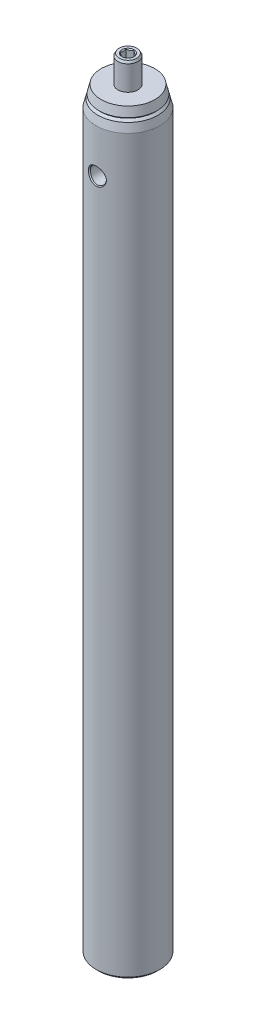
ISO-10303-21;
HEADER;
FILE_DESCRIPTION(('STEP AP214'),'2;1');
FILE_NAME('part.step','',(''),(''),'','','');
FILE_SCHEMA(('AUTOMOTIVE_DESIGN { 1 0 10303 214 1 1 1 1 }'));
ENDSEC;
DATA;
#1=APPLICATION_CONTEXT('core data for automotive mechanical design processes');
#2=APPLICATION_PROTOCOL_DEFINITION('international standard','automotive_design',2000,#1);
#3=PRODUCT_CONTEXT('',#1,'mechanical');
#4=PRODUCT('Part','Part','',(#3));
#5=PRODUCT_RELATED_PRODUCT_CATEGORY('part','',(#4));
#6=PRODUCT_DEFINITION_FORMATION('','',#4);
#7=PRODUCT_DEFINITION_CONTEXT('part definition',#1,'design');
#8=PRODUCT_DEFINITION('design','',#6,#7);
#9=PRODUCT_DEFINITION_SHAPE('','',#8);
#10=(LENGTH_UNIT() NAMED_UNIT(*) SI_UNIT(.MILLI.,.METRE.));
#11=(NAMED_UNIT(*) PLANE_ANGLE_UNIT() SI_UNIT($,.RADIAN.));
#12=(NAMED_UNIT(*) SI_UNIT($,.STERADIAN.) SOLID_ANGLE_UNIT());
#13=UNCERTAINTY_MEASURE_WITH_UNIT(LENGTH_MEASURE(1.E-05),#10,'distance_accuracy_value','');
#14=(GEOMETRIC_REPRESENTATION_CONTEXT(3) GLOBAL_UNCERTAINTY_ASSIGNED_CONTEXT((#13)) GLOBAL_UNIT_ASSIGNED_CONTEXT((#10,
#11,#12)) REPRESENTATION_CONTEXT('',''));
#15=CARTESIAN_POINT('',(0.,0.,0.));
#16=DIRECTION('',(0.,0.,1.));
#17=DIRECTION('',(1.,0.,0.));
#18=AXIS2_PLACEMENT_3D('',#15,#16,#17);
#19=CARTESIAN_POINT('',(0.,149.987,0.));
#20=DIRECTION('',(0.,-1.,0.));
#21=DIRECTION('',(0.,0.,-1.));
#22=AXIS2_PLACEMENT_3D('',#19,#20,#21);
#23=PLANE('',#22);
#24=CARTESIAN_POINT('',(0.,149.987,0.));
#25=DIRECTION('',(0.,-1.,0.));
#26=DIRECTION('',(0.,0.,-1.));
#27=AXIS2_PLACEMENT_3D('',#24,#25,#26);
#28=CIRCLE('',#27,1.90399999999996);
#29=CARTESIAN_POINT('',(0.,149.987,-1.90399999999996));
#30=VERTEX_POINT('',#29);
#31=EDGE_CURVE('P0_E11',#30,#30,#28,.T.);
#32=ORIENTED_EDGE('',*,*,#31,.T.);
#33=EDGE_LOOP('',(#32));
#34=FACE_BOUND('',#33,.T.);
#35=CARTESIAN_POINT('',(0.,149.987,0.));
#36=DIRECTION('',(0.,1.,0.));
#37=DIRECTION('',(0.,0.,1.));
#38=AXIS2_PLACEMENT_3D('',#35,#36,#37);
#39=CIRCLE('',#38,5.34669999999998);
#40=CARTESIAN_POINT('',(0.,149.987,5.34669999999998));
#41=VERTEX_POINT('',#40);
#42=EDGE_CURVE('P0_E64',#41,#41,#39,.T.);
#43=ORIENTED_EDGE('',*,*,#42,.T.);
#44=EDGE_LOOP('',(#43));
#45=FACE_BOUND('',#44,.T.);
#46=ADVANCED_FACE('P0_F17',(#34,#45),#23,.F.);
#47=CARTESIAN_POINT('',(0.,148.276690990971,0.));
#48=DIRECTION('',(0.,-1.,0.));
#49=DIRECTION('',(0.,0.,-1.));
#50=AXIS2_PLACEMENT_3D('',#47,#48,#49);
#51=CONICAL_SURFACE('',#50,5.76886488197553,0.241998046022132);
#52=ORIENTED_EDGE('',*,*,#42,.F.);
#53=EDGE_LOOP('',(#52));
#54=FACE_BOUND('',#53,.T.);
#55=CARTESIAN_POINT('',(0.,148.276690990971,0.));
#56=DIRECTION('',(0.,1.,0.));
#57=DIRECTION('',(0.,0.,1.));
#58=AXIS2_PLACEMENT_3D('',#55,#56,#57);
#59=CIRCLE('',#58,5.76886488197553);
#60=CARTESIAN_POINT('',(0.,148.276690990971,5.76886488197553));
#61=VERTEX_POINT('',#60);
#62=EDGE_CURVE('P0_E61',#61,#61,#59,.T.);
#63=ORIENTED_EDGE('',*,*,#62,.T.);
#64=EDGE_LOOP('',(#63));
#65=FACE_BOUND('',#64,.T.);
#66=ADVANCED_FACE('P0_F215',(#54,#65),#51,.T.);
#67=CARTESIAN_POINT('',(0.,147.98802,0.));
#68=DIRECTION('',(0.,1.,0.));
#69=DIRECTION('',(0.,0.,1.));
#70=AXIS2_PLACEMENT_3D('',#67,#68,#69);
#71=CONICAL_SURFACE('',#70,5.49909999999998,0.751555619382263);
#72=ORIENTED_EDGE('',*,*,#62,.F.);
#73=EDGE_LOOP('',(#72));
#74=FACE_BOUND('',#73,.T.);
#75=CARTESIAN_POINT('',(0.,147.98802,0.));
#76=DIRECTION('',(0.,1.,0.));
#77=DIRECTION('',(0.,0.,1.));
#78=AXIS2_PLACEMENT_3D('',#75,#76,#77);
#79=CIRCLE('',#78,5.49909999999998);
#80=CARTESIAN_POINT('',(0.,147.98802,5.49909999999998));
#81=VERTEX_POINT('',#80);
#82=EDGE_CURVE('P0_E58',#81,#81,#79,.T.);
#83=ORIENTED_EDGE('',*,*,#82,.T.);
#84=EDGE_LOOP('',(#83));
#85=FACE_BOUND('',#84,.T.);
#86=ADVANCED_FACE('P0_F220',(#74,#85),#71,.T.);
#87=CARTESIAN_POINT('',(0.,147.573783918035,0.));
#88=DIRECTION('',(0.,-1.,0.));
#89=DIRECTION('',(0.,0.,-1.));
#90=AXIS2_PLACEMENT_3D('',#87,#88,#89);
#91=CONICAL_SURFACE('',#90,5.94236726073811,0.819240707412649);
#92=ORIENTED_EDGE('',*,*,#82,.F.);
#93=EDGE_LOOP('',(#92));
#94=FACE_BOUND('',#93,.T.);
#95=CARTESIAN_POINT('',(0.,147.573783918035,0.));
#96=DIRECTION('',(0.,1.,0.));
#97=DIRECTION('',(0.,0.,1.));
#98=AXIS2_PLACEMENT_3D('',#95,#96,#97);
#99=CIRCLE('',#98,5.94236726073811);
#100=CARTESIAN_POINT('',(0.,147.573783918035,5.94236726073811));
#101=VERTEX_POINT('',#100);
#102=EDGE_CURVE('P0_E55',#101,#101,#99,.T.);
#103=ORIENTED_EDGE('',*,*,#102,.T.);
#104=EDGE_LOOP('',(#103));
#105=FACE_BOUND('',#104,.T.);
#106=ADVANCED_FACE('P0_F229',(#94,#105),#91,.T.);
#107=CARTESIAN_POINT('',(0.,145.9738,0.));
#108=DIRECTION('',(0.,-1.,0.));
#109=DIRECTION('',(0.,0.,-1.));
#110=AXIS2_PLACEMENT_3D('',#107,#108,#109);
#111=CONICAL_SURFACE('',#110,6.33729999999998,0.241998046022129);
#112=ORIENTED_EDGE('',*,*,#102,.F.);
#113=EDGE_LOOP('',(#112));
#114=FACE_BOUND('',#113,.T.);
#115=CARTESIAN_POINT('',(0.,145.9738,0.));
#116=DIRECTION('',(0.,1.,0.));
#117=DIRECTION('',(0.,0.,1.));
#118=AXIS2_PLACEMENT_3D('',#115,#116,#117);
#119=CIRCLE('',#118,6.33729999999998);
#120=CARTESIAN_POINT('',(0.,145.9738,6.33729999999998));
#121=VERTEX_POINT('',#120);
#122=EDGE_CURVE('P0_E52',#121,#121,#119,.T.);
#123=ORIENTED_EDGE('',*,*,#122,.T.);
#124=EDGE_LOOP('',(#123));
#125=FACE_BOUND('',#124,.T.);
#126=ADVANCED_FACE('P0_F89',(#114,#125),#111,.T.);
#127=CARTESIAN_POINT('',(0.,149.987,0.));
#128=DIRECTION('',(0.,1.,0.));
#129=DIRECTION('',(0.,0.,1.));
#130=AXIS2_PLACEMENT_3D('',#127,#128,#129);
#131=CYLINDRICAL_SURFACE('',#130,6.33729999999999);
#132=CARTESIAN_POINT('',(0.,135.558951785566,6.33729999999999));
#133=CARTESIAN_POINT('',(0.0294399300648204,135.558935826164,6.33730404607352));
#134=CARTESIAN_POINT('',(0.0588789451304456,135.559654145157,6.33707764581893));
#135=CARTESIAN_POINT('',(0.117621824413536,135.562534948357,6.33618719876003));
#136=CARTESIAN_POINT('',(0.1469258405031,135.564694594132,6.33552401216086));
#137=CARTESIAN_POINT('',(0.205337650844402,135.570429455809,6.33378438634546));
#138=CARTESIAN_POINT('',(0.234445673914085,135.574002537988,6.33270857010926));
#139=CARTESIAN_POINT('',(0.292405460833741,135.582535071,6.33016829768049));
#140=CARTESIAN_POINT('',(0.321257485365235,135.587492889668,6.32870429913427));
#141=CARTESIAN_POINT('',(0.378645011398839,135.598766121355,6.32541212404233));
#142=CARTESIAN_POINT('',(0.407180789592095,135.605080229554,6.32358429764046));
#143=CARTESIAN_POINT('',(0.463875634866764,135.619037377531,6.31958889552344));
#144=CARTESIAN_POINT('',(0.492034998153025,135.626679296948,6.31742160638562));
#145=CARTESIAN_POINT('',(0.547916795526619,135.643263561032,6.31277166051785));
#146=CARTESIAN_POINT('',(0.575639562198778,135.652204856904,6.31028925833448));
#147=CARTESIAN_POINT('',(0.630587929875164,135.6713594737,6.30503343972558));
#148=CARTESIAN_POINT('',(0.657813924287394,135.681571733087,6.30226026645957));
#149=CARTESIAN_POINT('',(0.711708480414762,135.703239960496,6.29644724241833));
#150=CARTESIAN_POINT('',(0.738377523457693,135.714694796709,6.29340763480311));
#151=CARTESIAN_POINT('',(0.791097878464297,135.738819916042,6.2870860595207));
#152=CARTESIAN_POINT('',(0.817149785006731,135.75148896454,6.28380433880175));
#153=CARTESIAN_POINT('',(0.868575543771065,135.778014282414,6.27702288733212));
#154=CARTESIAN_POINT('',(0.893950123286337,135.791869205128,6.27352340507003));
#155=CARTESIAN_POINT('',(0.943960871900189,135.820738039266,6.26633065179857));
#156=CARTESIAN_POINT('',(0.968597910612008,135.835750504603,6.26263762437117));
#157=CARTESIAN_POINT('',(1.01707325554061,135.866906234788,6.25508249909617));
#158=CARTESIAN_POINT('',(1.04091256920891,135.883047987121,6.25122062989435));
#159=CARTESIAN_POINT('',(1.08773198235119,135.916433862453,6.24335072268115));
#160=CARTESIAN_POINT('',(1.11071320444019,135.933676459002,6.23934289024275));
#161=CARTESIAN_POINT('',(1.15575658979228,135.969236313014,6.23121076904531));
#162=CARTESIAN_POINT('',(1.17781994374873,135.987552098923,6.22708664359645));
#163=CARTESIAN_POINT('',(1.22096551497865,136.025227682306,6.2187263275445));
#164=CARTESIAN_POINT('',(1.24204891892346,136.044586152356,6.21449028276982));
#165=CARTESIAN_POINT('',(1.28317150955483,136.084317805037,6.20600685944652));
#166=CARTESIAN_POINT('',(1.30321223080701,136.104689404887,6.20175950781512));
#167=CARTESIAN_POINT('',(1.34221596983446,136.146388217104,6.19335716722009));
#168=CARTESIAN_POINT('',(1.36118083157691,136.167713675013,6.18920202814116));
#169=CARTESIAN_POINT('',(1.39800144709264,136.211258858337,6.18099132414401));
#170=CARTESIAN_POINT('',(1.41585895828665,136.233477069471,6.17693560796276));
#171=CARTESIAN_POINT('',(1.45043566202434,136.278749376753,6.16895620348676));
#172=CARTESIAN_POINT('',(1.46715657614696,136.301802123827,6.16503232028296));
#173=CARTESIAN_POINT('',(1.49943021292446,136.348684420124,6.15734229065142));
#174=CARTESIAN_POINT('',(1.51498466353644,136.372512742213,6.15357591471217));
#175=CARTESIAN_POINT('',(1.54489561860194,136.420887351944,6.14622841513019));
#176=CARTESIAN_POINT('',(1.55925388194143,136.445432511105,6.14264702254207));
#177=CARTESIAN_POINT('',(1.58674263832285,136.495181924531,6.13569652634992));
#178=CARTESIAN_POINT('',(1.59987492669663,136.520385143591,6.13232711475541));
#179=CARTESIAN_POINT('',(1.62488191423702,136.571391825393,6.12582774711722));
#180=CARTESIAN_POINT('',(1.63675842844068,136.597194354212,6.1226974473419));
#181=CARTESIAN_POINT('',(1.65922406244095,136.649340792,6.11670343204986));
#182=CARTESIAN_POINT('',(1.66981497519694,136.675683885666,6.11383934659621));
#183=CARTESIAN_POINT('',(1.68967964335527,136.72885257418,6.10840488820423));
#184=CARTESIAN_POINT('',(1.69895509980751,136.755677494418,6.10583413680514));
#185=CARTESIAN_POINT('',(1.71615916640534,136.809750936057,6.10101345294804));
#186=CARTESIAN_POINT('',(1.72408928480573,136.836998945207,6.09876316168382));
#187=CARTESIAN_POINT('',(1.73857307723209,136.891859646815,6.09461047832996));
#188=CARTESIAN_POINT('',(1.74512793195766,136.919472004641,6.09270778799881));
#189=CARTESIAN_POINT('',(1.75683178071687,136.975002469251,6.08927733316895));
#190=CARTESIAN_POINT('',(1.76198145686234,137.002920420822,6.08774938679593));
#191=CARTESIAN_POINT('',(1.77084554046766,137.059003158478,6.08509542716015));
#192=CARTESIAN_POINT('',(1.77455992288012,137.087167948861,6.0839694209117));
#193=CARTESIAN_POINT('',(1.78052484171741,137.143685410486,6.0821461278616));
#194=CARTESIAN_POINT('',(1.78277440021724,137.172038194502,6.08144912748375));
#195=CARTESIAN_POINT('',(1.78577903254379,137.228872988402,6.08051108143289));
#196=CARTESIAN_POINT('',(1.78653189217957,137.257355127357,6.08027071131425));
#197=CARTESIAN_POINT('',(1.78652142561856,137.314319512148,6.0802710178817));
#198=CARTESIAN_POINT('',(1.78575806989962,137.342801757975,6.0805117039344));
#199=CARTESIAN_POINT('',(1.78274505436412,137.399637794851,6.08144750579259));
#200=CARTESIAN_POINT('',(1.78049756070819,137.427991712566,6.08214195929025));
#201=CARTESIAN_POINT('',(1.77454464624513,137.484512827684,6.0839584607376));
#202=CARTESIAN_POINT('',(1.77084019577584,137.512680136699,6.08508022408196));
#203=CARTESIAN_POINT('',(1.76200373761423,137.56876972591,6.08772409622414));
#204=CARTESIAN_POINT('',(1.75687176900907,137.596692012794,6.08924619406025));
#205=CARTESIAN_POINT('',(1.74520976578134,137.652233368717,6.09266372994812));
#206=CARTESIAN_POINT('',(1.73867907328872,137.679852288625,6.09455934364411));
#207=CARTESIAN_POINT('',(1.7242490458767,137.734728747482,6.09869695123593));
#208=CARTESIAN_POINT('',(1.71634855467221,137.761985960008,6.1009392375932));
#209=CARTESIAN_POINT('',(1.69920811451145,137.816080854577,6.10574330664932));
#210=CARTESIAN_POINT('',(1.68996667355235,137.842918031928,6.10830544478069));
#211=CARTESIAN_POINT('',(1.6701733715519,137.896114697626,6.11372238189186));
#212=CARTESIAN_POINT('',(1.65961981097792,137.922473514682,6.11657755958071));
#213=CARTESIAN_POINT('',(1.63723117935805,137.97465528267,6.12255377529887));
#214=CARTESIAN_POINT('',(1.62539429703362,138.000477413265,6.12567518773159));
#215=CARTESIAN_POINT('',(1.60046784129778,138.05152760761,6.13215710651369));
#216=CARTESIAN_POINT('',(1.58737641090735,138.076754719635,6.13551796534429));
#217=CARTESIAN_POINT('',(1.55996960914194,138.126556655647,6.14245199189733));
#218=CARTESIAN_POINT('',(1.545652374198,138.151130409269,6.14602548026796));
#219=CARTESIAN_POINT('',(1.51582269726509,138.199567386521,6.15335811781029));
#220=CARTESIAN_POINT('',(1.50030840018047,138.223429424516,6.15711755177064));
#221=CARTESIAN_POINT('',(1.4681132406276,138.270384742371,6.16479495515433));
#222=CARTESIAN_POINT('',(1.45143052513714,138.293476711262,6.16871317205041));
#223=CARTESIAN_POINT('',(1.4169274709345,138.338833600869,6.17668281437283));
#224=CARTESIAN_POINT('',(1.39910525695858,138.361097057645,6.18073445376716));
#225=CARTESIAN_POINT('',(1.36235107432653,138.404738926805,6.18893888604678));
#226=CARTESIAN_POINT('',(1.34341716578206,138.426115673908,6.19309184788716));
#227=CARTESIAN_POINT('',(1.30447161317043,138.467925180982,6.20149204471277));
#228=CARTESIAN_POINT('',(1.28445791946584,138.488355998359,6.20573944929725));
#229=CARTESIAN_POINT('',(1.24338256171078,138.528205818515,6.21422472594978));
#230=CARTESIAN_POINT('',(1.22231929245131,138.547623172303,6.21846257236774));
#231=CARTESIAN_POINT('',(1.17920582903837,138.585407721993,6.22682733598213));
#232=CARTESIAN_POINT('',(1.15715450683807,138.603773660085,6.23095411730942));
#233=CARTESIAN_POINT('',(1.11212941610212,138.639427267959,6.23909234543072));
#234=CARTESIAN_POINT('',(1.08915449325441,138.656713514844,6.2431036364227));
#235=CARTESIAN_POINT('',(1.042342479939,138.690180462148,6.25098116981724));
#236=CARTESIAN_POINT('',(1.01850428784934,138.706359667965,6.25484721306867));
#237=CARTESIAN_POINT('',(0.970027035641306,138.737584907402,6.26241131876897));
#238=CARTESIAN_POINT('',(0.9453869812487,138.752629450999,6.26610915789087));
#239=CARTESIAN_POINT('',(0.895366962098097,138.78155772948,6.27331208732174));
#240=CARTESIAN_POINT('',(0.869986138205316,138.795440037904,6.27681693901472));
#241=CARTESIAN_POINT('',(0.818545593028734,138.822016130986,6.28360960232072));
#242=CARTESIAN_POINT('',(0.792485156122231,138.834708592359,6.2868971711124));
#243=CARTESIAN_POINT('',(0.73974637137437,138.858877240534,6.29323083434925));
#244=CARTESIAN_POINT('',(0.713067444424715,138.870352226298,6.2962766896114));
#245=CARTESIAN_POINT('',(0.659152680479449,138.89205815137,6.30210251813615));
#246=CARTESIAN_POINT('',(0.631916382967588,138.902288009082,6.30488225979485));
#247=CARTESIAN_POINT('',(0.576947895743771,138.921475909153,6.31015143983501));
#248=CARTESIAN_POINT('',(0.54921533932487,138.93043296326,6.31264065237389));
#249=CARTESIAN_POINT('',(0.493315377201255,138.947047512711,6.31730435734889));
#250=CARTESIAN_POINT('',(0.465147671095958,138.954704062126,6.31947862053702));
#251=CARTESIAN_POINT('',(0.408438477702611,138.968689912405,6.32348801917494));
#252=CARTESIAN_POINT('',(0.379896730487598,138.975018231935,6.32532290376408));
#253=CARTESIAN_POINT('',(0.32250055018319,138.986320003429,6.32862915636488));
#254=CARTESIAN_POINT('',(0.293645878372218,138.991292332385,6.33010022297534));
#255=CARTESIAN_POINT('',(0.235684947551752,138.99985464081,6.33265448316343));
#256=CARTESIAN_POINT('',(0.206578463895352,139.003443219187,6.33373728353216));
#257=CARTESIAN_POINT('',(0.148175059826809,139.009210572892,6.3354906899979));
#258=CARTESIAN_POINT('',(0.118877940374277,139.011387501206,6.33616075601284));
#259=CARTESIAN_POINT('',(0.0601542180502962,139.014304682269,6.33706445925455));
#260=CARTESIAN_POINT('',(0.0307274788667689,139.015042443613,6.33729733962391));
#261=CARTESIAN_POINT('',(-0.028131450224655,139.015053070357,6.33730239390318));
#262=CARTESIAN_POINT('',(-0.0575636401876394,139.014325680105,6.33707448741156));
#263=CARTESIAN_POINT('',(-0.116308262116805,139.011427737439,6.33618067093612));
#264=CARTESIAN_POINT('',(-0.14562080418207,139.009259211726,6.33551537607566));
#265=CARTESIAN_POINT('',(-0.204063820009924,139.003508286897,6.33377147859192));
#266=CARTESIAN_POINT('',(-0.233194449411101,138.99992733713,6.33269329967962));
#267=CARTESIAN_POINT('',(-0.29121118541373,138.991380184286,6.33014820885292));
#268=CARTESIAN_POINT('',(-0.320097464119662,138.986415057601,6.32868159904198));
#269=CARTESIAN_POINT('',(-0.377563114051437,138.975128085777,6.32538416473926));
#270=CARTESIAN_POINT('',(-0.406142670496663,138.968807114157,6.32355357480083));
#271=CARTESIAN_POINT('',(-0.462932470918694,138.954836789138,6.3195526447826));
#272=CARTESIAN_POINT('',(-0.491142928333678,138.947188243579,6.31738251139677));
#273=CARTESIAN_POINT('',(-0.547132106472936,138.930590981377,6.31272692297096));
#274=CARTESIAN_POINT('',(-0.574911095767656,138.921643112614,6.31024167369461));
#275=CARTESIAN_POINT('',(-0.629974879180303,138.902475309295,6.30498025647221));
#276=CARTESIAN_POINT('',(-0.657260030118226,138.892256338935,6.30220430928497));
#277=CARTESIAN_POINT('',(-0.711273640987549,138.870574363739,6.29638588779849));
#278=CARTESIAN_POINT('',(-0.738002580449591,138.85911248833,6.29334365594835));
#279=CARTESIAN_POINT('',(-0.790841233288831,138.834972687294,6.28701704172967));
#280=CARTESIAN_POINT('',(-0.816951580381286,138.822296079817,6.28373292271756));
#281=CARTESIAN_POINT('',(-0.868490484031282,138.795754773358,6.27694694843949));
#282=CARTESIAN_POINT('',(-0.893919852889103,138.781891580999,6.27344537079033));
#283=CARTESIAN_POINT('',(-0.94403419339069,138.753005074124,6.26624876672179));
#284=CARTESIAN_POINT('',(-0.968720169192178,138.737983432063,6.26255402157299));
#285=CARTESIAN_POINT('',(-1.01728516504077,138.706807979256,6.2549958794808));
#286=CARTESIAN_POINT('',(-1.0411653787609,138.690655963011,6.25113275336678));
#287=CARTESIAN_POINT('',(-1.08805606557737,138.657247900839,6.24326080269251));
#288=CARTESIAN_POINT('',(-1.11106789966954,138.63999370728,6.23925222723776));
#289=CARTESIAN_POINT('',(-1.15615992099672,138.604408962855,6.23111925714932));
#290=CARTESIAN_POINT('',(-1.17824158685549,138.586080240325,6.2269950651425));
#291=CARTESIAN_POINT('',(-1.22140823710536,138.548376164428,6.21863501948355));
#292=CARTESIAN_POINT('',(-1.24249474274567,138.529002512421,6.21439935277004));
#293=CARTESIAN_POINT('',(-1.28361269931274,138.489236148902,6.2059174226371));
#294=CARTESIAN_POINT('',(-1.3036458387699,138.468845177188,6.20167118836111));
#295=CARTESIAN_POINT('',(-1.34263154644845,138.427103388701,6.19327195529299));
#296=CARTESIAN_POINT('',(-1.36158588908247,138.405754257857,6.18911881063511));
#297=CARTESIAN_POINT('',(-1.3983825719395,138.362157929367,6.18091254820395));
#298=CARTESIAN_POINT('',(-1.41622659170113,138.339912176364,6.17685928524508));
#299=CARTESIAN_POINT('',(-1.45077430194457,138.294582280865,6.16888519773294));
#300=CARTESIAN_POINT('',(-1.46747963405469,138.271499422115,6.16496418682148));
#301=CARTESIAN_POINT('',(-1.49972072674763,138.22455545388,6.15728016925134));
#302=CARTESIAN_POINT('',(-1.51525814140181,138.200695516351,6.15351694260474));
#303=CARTESIAN_POINT('',(-1.54513433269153,138.152257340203,6.14617589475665));
#304=CARTESIAN_POINT('',(-1.55947480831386,138.127680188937,6.14259781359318));
#305=CARTESIAN_POINT('',(-1.58692795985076,138.077867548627,6.13565397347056));
#306=CARTESIAN_POINT('',(-1.60004239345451,138.052633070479,6.13228791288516));
#307=CARTESIAN_POINT('',(-1.62501430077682,138.001565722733,6.1257951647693));
#308=CARTESIAN_POINT('',(-1.63687358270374,137.97573378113,6.12266813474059));
#309=CARTESIAN_POINT('',(-1.65930603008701,137.923531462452,6.11668046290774));
#310=CARTESIAN_POINT('',(-1.66988102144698,137.897161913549,6.11381944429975));
#311=CARTESIAN_POINT('',(-1.68971576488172,137.843944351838,6.10839081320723));
#312=CARTESIAN_POINT('',(-1.69897730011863,137.817097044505,6.10582280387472));
#313=CARTESIAN_POINT('',(-1.7161560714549,137.762983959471,6.10100719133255));
#314=CARTESIAN_POINT('',(-1.72407495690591,137.735718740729,6.09875919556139));
#315=CARTESIAN_POINT('',(-1.73853945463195,137.680829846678,6.09461058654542));
#316=CARTESIAN_POINT('',(-1.74508645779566,137.653206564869,6.09270962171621));
#317=CARTESIAN_POINT('',(-1.75677836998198,137.597661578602,6.08928200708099));
#318=CARTESIAN_POINT('',(-1.76192425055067,137.56974009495,6.08775509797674));
#319=CARTESIAN_POINT('',(-1.7707851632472,137.513658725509,6.08510249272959));
#320=CARTESIAN_POINT('',(-1.77450054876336,137.485498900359,6.08397669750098));
#321=CARTESIAN_POINT('',(-1.78047228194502,137.429000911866,6.08215307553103));
#322=CARTESIAN_POINT('',(-1.78272812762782,137.400662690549,6.0814553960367));
#323=CARTESIAN_POINT('',(-1.78575147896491,137.343867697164,6.08051493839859));
#324=CARTESIAN_POINT('',(-1.7865173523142,137.315410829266,6.08027265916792));
#325=CARTESIAN_POINT('',(-1.78653677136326,137.258502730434,6.0802688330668));
#326=CARTESIAN_POINT('',(-1.78579064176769,137.230051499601,6.08050718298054));
#327=CARTESIAN_POINT('',(-1.7828130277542,137.17327775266,6.08143863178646));
#328=CARTESIAN_POINT('',(-1.78058377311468,137.144955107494,6.08213104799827));
#329=CARTESIAN_POINT('',(-1.77466841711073,137.088496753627,6.08394357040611));
#330=CARTESIAN_POINT('',(-1.77098334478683,137.060360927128,6.08506337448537));
#331=CARTESIAN_POINT('',(-1.76218590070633,137.004334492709,6.08770347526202));
#332=CARTESIAN_POINT('',(-1.75707361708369,136.976443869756,6.08922374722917));
#333=CARTESIAN_POINT('',(-1.74545068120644,136.920965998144,6.09263775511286));
#334=CARTESIAN_POINT('',(-1.73893940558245,136.893378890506,6.09453165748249));
#335=CARTESIAN_POINT('',(-1.72454728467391,136.838566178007,6.09866596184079));
#336=CARTESIAN_POINT('',(-1.71666529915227,136.811340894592,6.10090665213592));
#337=CARTESIAN_POINT('',(-1.69956034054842,136.757309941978,6.10570763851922));
#338=CARTESIAN_POINT('',(-1.69033586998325,136.730504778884,6.1082682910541));
#339=CARTESIAN_POINT('',(-1.67057437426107,136.677372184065,6.11368235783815));
#340=CARTESIAN_POINT('',(-1.66003562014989,136.651045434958,6.11653615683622));
#341=CARTESIAN_POINT('',(-1.63767386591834,136.598927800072,6.1225097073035));
#342=CARTESIAN_POINT('',(-1.62584899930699,136.573137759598,6.12562984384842));
#343=CARTESIAN_POINT('',(-1.60094323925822,136.522151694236,6.13210929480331));
#344=CARTESIAN_POINT('',(-1.58786040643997,136.496956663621,6.13546897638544));
#345=CARTESIAN_POINT('',(-1.56046686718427,136.447218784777,6.14240072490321));
#346=CARTESIAN_POINT('',(-1.54615418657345,136.422677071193,6.14597313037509));
#347=CARTESIAN_POINT('',(-1.51632908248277,136.374304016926,6.15330367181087));
#348=CARTESIAN_POINT('',(-1.50081466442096,136.350473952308,6.15706211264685));
#349=CARTESIAN_POINT('',(-1.46861415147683,136.3035823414,6.16473759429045));
#350=CARTESIAN_POINT('',(-1.45192603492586,136.280522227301,6.16865490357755));
#351=CARTESIAN_POINT('',(-1.41740639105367,136.235228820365,6.17662278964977));
#352=CARTESIAN_POINT('',(-1.39957279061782,136.21299714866,6.18067360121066));
#353=CARTESIAN_POINT('',(-1.36278974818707,136.16941825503,6.18887643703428));
#354=CARTESIAN_POINT('',(-1.34383814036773,136.148072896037,6.19302864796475));
#355=CARTESIAN_POINT('',(-1.30484939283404,136.106326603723,6.20142739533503));
#356=CARTESIAN_POINT('',(-1.28480994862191,136.085927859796,6.20567411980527));
#357=CARTESIAN_POINT('',(-1.24367802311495,136.046137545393,6.21415825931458));
#358=CARTESIAN_POINT('',(-1.22258362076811,136.026747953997,6.21839564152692));
#359=CARTESIAN_POINT('',(-1.17940611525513,135.989009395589,6.22675999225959));
#360=CARTESIAN_POINT('',(-1.15732157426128,135.970662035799,6.23088678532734));
#361=CARTESIAN_POINT('',(-1.11222765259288,135.935038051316,6.23902550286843));
#362=CARTESIAN_POINT('',(-1.08921687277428,135.917763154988,6.24303723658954));
#363=CARTESIAN_POINT('',(-1.04233151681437,135.884311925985,6.25091606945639));
#364=CARTESIAN_POINT('',(-1.01845565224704,135.868137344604,6.25478293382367));
#365=CARTESIAN_POINT('',(-0.969901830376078,135.836915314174,6.26234904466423));
#366=CARTESIAN_POINT('',(-0.945222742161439,135.821869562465,6.26604803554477));
#367=CARTESIAN_POINT('',(-0.89512394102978,135.792933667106,6.27325357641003));
#368=CARTESIAN_POINT('',(-0.869703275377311,135.779045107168,6.27675986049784));
#369=CARTESIAN_POINT('',(-0.818182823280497,135.752452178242,6.28355564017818));
#370=CARTESIAN_POINT('',(-0.792082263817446,135.739749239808,6.286844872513));
#371=CARTESIAN_POINT('',(-0.739263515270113,135.715556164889,6.29318205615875));
#372=CARTESIAN_POINT('',(-0.712544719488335,135.704067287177,6.29622975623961));
#373=CARTESIAN_POINT('',(-0.658551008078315,135.682330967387,6.30205940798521));
#374=CARTESIAN_POINT('',(-0.631275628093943,135.672084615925,6.30484112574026));
#375=CARTESIAN_POINT('',(-0.576230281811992,135.652861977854,6.31011433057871));
#376=CARTESIAN_POINT('',(-0.548459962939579,135.643886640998,6.31260560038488));
#377=CARTESIAN_POINT('',(-0.492486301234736,135.627234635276,6.31727343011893));
#378=CARTESIAN_POINT('',(-0.464282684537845,135.619558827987,6.31944978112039));
#379=CARTESIAN_POINT('',(-0.407504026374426,135.605534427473,6.32346330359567));
#380=CARTESIAN_POINT('',(-0.378928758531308,135.599186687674,6.32530025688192));
#381=CARTESIAN_POINT('',(-0.321468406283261,135.587846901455,6.32861052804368));
#382=CARTESIAN_POINT('',(-0.292583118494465,135.582855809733,6.3300835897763));
#383=CARTESIAN_POINT('',(-0.234564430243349,135.574257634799,6.33264167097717));
#384=CARTESIAN_POINT('',(-0.205430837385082,135.570651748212,6.33372635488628));
#385=CARTESIAN_POINT('',(-0.146976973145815,135.564852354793,6.335483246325));
#386=CARTESIAN_POINT('',(-0.117656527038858,135.562660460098,6.33615498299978));
#387=CARTESIAN_POINT('',(-0.0588914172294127,135.559716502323,6.33706186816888));
#388=CARTESIAN_POINT('',(-0.029446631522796,135.558966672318,6.33729633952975));
#389=CARTESIAN_POINT('',(0.,135.558951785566,6.33729999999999));
#390=B_SPLINE_CURVE_WITH_KNOTS('',3,(#132,#133,#134,#135,#136,#137,#138,#139,#140,#141,#142,
#143,#144,#145,#146,#147,#148,#149,#150,#151,#152,#153,#154,#155,#156,#157,#158,#159,#160,#161,
#162,#163,#164,#165,#166,#167,#168,#169,#170,#171,#172,#173,#174,#175,#176,#177,#178,#179,#180,
#181,#182,#183,#184,#185,#186,#187,#188,#189,#190,#191,#192,#193,#194,#195,#196,#197,#198,#199,
#200,#201,#202,#203,#204,#205,#206,#207,#208,#209,#210,#211,#212,#213,#214,#215,#216,#217,#218,
#219,#220,#221,#222,#223,#224,#225,#226,#227,#228,#229,#230,#231,#232,#233,#234,#235,#236,#237,
#238,#239,#240,#241,#242,#243,#244,#245,#246,#247,#248,#249,#250,#251,#252,#253,#254,#255,#256,
#257,#258,#259,#260,#261,#262,#263,#264,#265,#266,#267,#268,#269,#270,#271,#272,#273,#274,#275,
#276,#277,#278,#279,#280,#281,#282,#283,#284,#285,#286,#287,#288,#289,#290,#291,#292,#293,#294,
#295,#296,#297,#298,#299,#300,#301,#302,#303,#304,#305,#306,#307,#308,#309,#310,#311,#312,#313,
#314,#315,#316,#317,#318,#319,#320,#321,#322,#323,#324,#325,#326,#327,#328,#329,#330,#331,#332,
#333,#334,#335,#336,#337,#338,#339,#340,#341,#342,#343,#344,#345,#346,#347,#348,#349,#350,#351,
#352,#353,#354,#355,#356,#357,#358,#359,#360,#361,#362,#363,#364,#365,#366,#367,#368,#369,#370,
#371,#372,#373,#374,#375,#376,#377,#378,#379,#380,#381,#382,#383,#384,#385,#386,#387,#388,#389),
.UNSPECIFIED.,.F.,.F.,(4,2,2,2,2,2,2,2,2,2,2,2,2,2,2,2,2,2,2,2,2,2,2,2,2,2,2,2,2,2,2,2,2,2,2,2,
2,2,2,2,2,2,2,2,2,2,2,2,2,2,2,2,2,2,2,2,2,2,2,2,2,2,2,2,2,2,2,2,2,2,2,2,2,2,2,2,2,2,2,2,2,2,2,2,
2,2,2,2,2,2,2,2,2,2,2,2,2,2,2,2,2,2,2,2,2,2,2,2,2,2,2,2,2,2,2,2,2,2,2,2,2,2,2,2,2,2,2,2,4),(0.,
0.0883078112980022,0.176442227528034,0.264444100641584,0.352342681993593,0.440157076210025,
0.527897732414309,0.615567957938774,0.70316544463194,0.790683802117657,0.878114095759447,
0.965446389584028,1.05267129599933,1.13978153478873,1.22677350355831,1.31364886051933,
1.40041611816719,1.48705183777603,1.57353427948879,1.65987575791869,1.7460834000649,
1.83216070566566,1.9181091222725,2.00392963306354,2.08962435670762,2.17519815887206,
2.26066027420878,2.34602593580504,2.43131800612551,2.51656859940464,2.6018206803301,
2.6871296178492,2.77256466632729,2.85800137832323,2.94331366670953,3.02856923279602,
3.11382246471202,3.19911588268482,3.2844816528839,3.36994314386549,3.45551650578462,
3.54121225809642,3.62703687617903,3.71299437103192,3.79908785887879,3.88532111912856,
3.97170013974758,4.05823464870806,4.14493962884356,4.23178154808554,4.31872527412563,
4.4057812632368,4.49295255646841,4.58023639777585,4.66762584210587,4.75511135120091,
4.84268237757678,4.93032893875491,5.01804318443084,5.10582095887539,5.19366335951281,
5.28157829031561,5.36958200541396,5.45770063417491,5.54597167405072,5.63425811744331,
5.72242066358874,5.81049297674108,5.89849699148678,5.98644447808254,6.07433863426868,
6.16217569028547,6.2499465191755,6.33763824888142,6.42523587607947,6.5127238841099,
6.60008786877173,6.68731617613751,6.77440155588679,6.86134283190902,6.94814658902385,
7.03480667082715,7.12131982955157,7.20769877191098,7.29395042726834,7.38007753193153,
7.46608022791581,7.5519576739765,7.63770966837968,7.72333828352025,7.80884951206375,
7.89425492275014,7.97957332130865,8.06483240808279,8.15007041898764,8.23533773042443,
8.32069840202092,8.40604074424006,8.49125506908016,8.57640926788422,8.66155820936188,
8.74674517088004,8.83200333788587,8.91735734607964,9.00282484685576,9.0884180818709,
9.17414545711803,9.26001311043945,9.34602646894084,9.43219179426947,9.51851771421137,
9.60501673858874,9.69170675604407,9.77856083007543,9.86554539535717,9.9526666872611,
10.0399235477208,10.1273090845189,10.2148123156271,10.3024197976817,10.3901172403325,
10.4778911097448,10.565730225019,10.6536273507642,10.7415807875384,10.8295959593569,
10.9176869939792,11.0058782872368,11.0942060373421),.UNSPECIFIED.);
#391=CARTESIAN_POINT('',(0.,135.558951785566,6.33729999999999));
#392=VERTEX_POINT('',#391);
#393=EDGE_CURVE('P0_E135',#392,#392,#390,.F.);
#394=ORIENTED_EDGE('',*,*,#393,.T.);
#395=EDGE_LOOP('',(#394));
#396=FACE_BOUND('',#395,.T.);
#397=CARTESIAN_POINT('',(0.,139.015048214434,-6.3373));
#398=CARTESIAN_POINT('',(0.0294399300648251,139.015064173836,-6.33730404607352));
#399=CARTESIAN_POINT('',(0.0588789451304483,139.014345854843,-6.33707764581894));
#400=CARTESIAN_POINT('',(0.117621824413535,139.011465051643,-6.33618719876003));
#401=CARTESIAN_POINT('',(0.146925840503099,139.009305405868,-6.33552401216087));
#402=CARTESIAN_POINT('',(0.205337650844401,139.003570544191,-6.33378438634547));
#403=CARTESIAN_POINT('',(0.234445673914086,138.999997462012,-6.33270857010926));
#404=CARTESIAN_POINT('',(0.292405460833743,138.991464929,-6.33016829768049));
#405=CARTESIAN_POINT('',(0.321257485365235,138.986507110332,-6.32870429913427));
#406=CARTESIAN_POINT('',(0.378645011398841,138.975233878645,-6.32541212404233));
#407=CARTESIAN_POINT('',(0.407180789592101,138.968919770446,-6.32358429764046));
#408=CARTESIAN_POINT('',(0.463875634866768,138.954962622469,-6.31958889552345));
#409=CARTESIAN_POINT('',(0.492034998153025,138.947320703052,-6.31742160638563));
#410=CARTESIAN_POINT('',(0.547916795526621,138.930736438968,-6.31277166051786));
#411=CARTESIAN_POINT('',(0.575639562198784,138.921795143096,-6.31028925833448));
#412=CARTESIAN_POINT('',(0.630587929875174,138.9026405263,-6.30503343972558));
#413=CARTESIAN_POINT('',(0.657813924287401,138.892428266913,-6.30226026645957));
#414=CARTESIAN_POINT('',(0.711708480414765,138.870760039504,-6.29644724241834));
#415=CARTESIAN_POINT('',(0.738377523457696,138.859305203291,-6.29340763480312));
#416=CARTESIAN_POINT('',(0.791097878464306,138.835180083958,-6.2870860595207));
#417=CARTESIAN_POINT('',(0.817149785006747,138.82251103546,-6.28380433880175));
#418=CARTESIAN_POINT('',(0.868575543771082,138.795985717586,-6.27702288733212));
#419=CARTESIAN_POINT('',(0.893950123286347,138.782130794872,-6.27352340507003));
#420=CARTESIAN_POINT('',(0.943960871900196,138.753261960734,-6.26633065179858));
#421=CARTESIAN_POINT('',(0.968597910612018,138.738249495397,-6.26263762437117));
#422=CARTESIAN_POINT('',(1.01707325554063,138.707093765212,-6.25508249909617));
#423=CARTESIAN_POINT('',(1.04091256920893,138.690952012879,-6.25122062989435));
#424=CARTESIAN_POINT('',(1.0877319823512,138.657566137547,-6.24335072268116));
#425=CARTESIAN_POINT('',(1.11071320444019,138.640323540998,-6.23934289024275));
#426=CARTESIAN_POINT('',(1.15575658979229,138.604763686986,-6.23121076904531));
#427=CARTESIAN_POINT('',(1.17781994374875,138.586447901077,-6.22708664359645));
#428=CARTESIAN_POINT('',(1.22096551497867,138.548772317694,-6.2187263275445));
#429=CARTESIAN_POINT('',(1.24204891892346,138.529413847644,-6.21449028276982));
#430=CARTESIAN_POINT('',(1.28317150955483,138.489682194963,-6.20600685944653));
#431=CARTESIAN_POINT('',(1.30321223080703,138.469310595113,-6.20175950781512));
#432=CARTESIAN_POINT('',(1.34221596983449,138.427611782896,-6.19335716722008));
#433=CARTESIAN_POINT('',(1.36118083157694,138.406286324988,-6.18920202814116));
#434=CARTESIAN_POINT('',(1.39800144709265,138.362741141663,-6.18099132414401));
#435=CARTESIAN_POINT('',(1.41585895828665,138.340522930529,-6.17693560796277));
#436=CARTESIAN_POINT('',(1.45043566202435,138.295250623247,-6.16895620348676));
#437=CARTESIAN_POINT('',(1.46715657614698,138.272197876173,-6.16503232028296));
#438=CARTESIAN_POINT('',(1.49943021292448,138.225315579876,-6.15734229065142));
#439=CARTESIAN_POINT('',(1.51498466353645,138.201487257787,-6.15357591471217));
#440=CARTESIAN_POINT('',(1.54489561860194,138.153112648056,-6.14622841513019));
#441=CARTESIAN_POINT('',(1.55925388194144,138.128567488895,-6.14264702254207));
#442=CARTESIAN_POINT('',(1.58674263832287,138.078818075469,-6.13569652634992));
#443=CARTESIAN_POINT('',(1.59987492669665,138.053614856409,-6.13232711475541));
#444=CARTESIAN_POINT('',(1.62488191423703,138.002608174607,-6.12582774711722));
#445=CARTESIAN_POINT('',(1.63675842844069,137.976805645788,-6.1226974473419));
#446=CARTESIAN_POINT('',(1.65922406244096,137.924659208,-6.11670343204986));
#447=CARTESIAN_POINT('',(1.66981497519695,137.898316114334,-6.11383934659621));
#448=CARTESIAN_POINT('',(1.68967964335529,137.84514742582,-6.10840488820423));
#449=CARTESIAN_POINT('',(1.69895509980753,137.818322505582,-6.10583413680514));
#450=CARTESIAN_POINT('',(1.71615916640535,137.764249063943,-6.10101345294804));
#451=CARTESIAN_POINT('',(1.72408928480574,137.737001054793,-6.09876316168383));
#452=CARTESIAN_POINT('',(1.7385730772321,137.682140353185,-6.09461047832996));
#453=CARTESIAN_POINT('',(1.74512793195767,137.654527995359,-6.09270778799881));
#454=CARTESIAN_POINT('',(1.75683178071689,137.598997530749,-6.08927733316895));
#455=CARTESIAN_POINT('',(1.76198145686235,137.571079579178,-6.08774938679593));
#456=CARTESIAN_POINT('',(1.77084554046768,137.514996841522,-6.08509542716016));
#457=CARTESIAN_POINT('',(1.77455992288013,137.486832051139,-6.0839694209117));
#458=CARTESIAN_POINT('',(1.78052484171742,137.430314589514,-6.0821461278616));
#459=CARTESIAN_POINT('',(1.78277440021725,137.401961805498,-6.08144912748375));
#460=CARTESIAN_POINT('',(1.7857790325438,137.345127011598,-6.08051108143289));
#461=CARTESIAN_POINT('',(1.78653189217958,137.316644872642,-6.08027071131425));
#462=CARTESIAN_POINT('',(1.78652142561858,137.259680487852,-6.0802710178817));
#463=CARTESIAN_POINT('',(1.78575806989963,137.231198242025,-6.0805117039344));
#464=CARTESIAN_POINT('',(1.78274505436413,137.174362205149,-6.08144750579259));
#465=CARTESIAN_POINT('',(1.7804975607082,137.146008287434,-6.08214195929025));
#466=CARTESIAN_POINT('',(1.77454464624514,137.089487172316,-6.08395846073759));
#467=CARTESIAN_POINT('',(1.77084019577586,137.061319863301,-6.08508022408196));
#468=CARTESIAN_POINT('',(1.76200373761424,137.00523027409,-6.08772409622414));
#469=CARTESIAN_POINT('',(1.75687176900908,136.977307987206,-6.08924619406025));
#470=CARTESIAN_POINT('',(1.74520976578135,136.921766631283,-6.09266372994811));
#471=CARTESIAN_POINT('',(1.73867907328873,136.894147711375,-6.0945593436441));
#472=CARTESIAN_POINT('',(1.72424904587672,136.839271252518,-6.09869695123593));
#473=CARTESIAN_POINT('',(1.71634855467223,136.812014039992,-6.1009392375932));
#474=CARTESIAN_POINT('',(1.69920811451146,136.757919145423,-6.10574330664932));
#475=CARTESIAN_POINT('',(1.68996667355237,136.731081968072,-6.10830544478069));
#476=CARTESIAN_POINT('',(1.67017337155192,136.677885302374,-6.11372238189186));
#477=CARTESIAN_POINT('',(1.65961981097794,136.651526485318,-6.11657755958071));
#478=CARTESIAN_POINT('',(1.63723117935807,136.59934471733,-6.12255377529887));
#479=CARTESIAN_POINT('',(1.62539429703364,136.573522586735,-6.12567518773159));
#480=CARTESIAN_POINT('',(1.6004678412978,136.52247239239,-6.13215710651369));
#481=CARTESIAN_POINT('',(1.58737641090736,136.497245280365,-6.13551796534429));
#482=CARTESIAN_POINT('',(1.55996960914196,136.447443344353,-6.14245199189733));
#483=CARTESIAN_POINT('',(1.54565237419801,136.422869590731,-6.14602548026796));
#484=CARTESIAN_POINT('',(1.51582269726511,136.374432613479,-6.15335811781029));
#485=CARTESIAN_POINT('',(1.5003084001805,136.350570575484,-6.15711755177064));
#486=CARTESIAN_POINT('',(1.46811324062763,136.303615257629,-6.16479495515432));
#487=CARTESIAN_POINT('',(1.45143052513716,136.280523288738,-6.16871317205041));
#488=CARTESIAN_POINT('',(1.41692747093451,136.235166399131,-6.17668281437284));
#489=CARTESIAN_POINT('',(1.3991052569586,136.212902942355,-6.18073445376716));
#490=CARTESIAN_POINT('',(1.36235107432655,136.169261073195,-6.18893888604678));
#491=CARTESIAN_POINT('',(1.34341716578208,136.147884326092,-6.19309184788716));
#492=CARTESIAN_POINT('',(1.30447161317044,136.106074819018,-6.20149204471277));
#493=CARTESIAN_POINT('',(1.28445791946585,136.085644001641,-6.20573944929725));
#494=CARTESIAN_POINT('',(1.24338256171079,136.045794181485,-6.21422472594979));
#495=CARTESIAN_POINT('',(1.22231929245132,136.026376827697,-6.21846257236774));
#496=CARTESIAN_POINT('',(1.17920582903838,135.988592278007,-6.22682733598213));
#497=CARTESIAN_POINT('',(1.15715450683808,135.970226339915,-6.23095411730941));
#498=CARTESIAN_POINT('',(1.11212941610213,135.934572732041,-6.23909234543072));
#499=CARTESIAN_POINT('',(1.08915449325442,135.917286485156,-6.24310363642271));
#500=CARTESIAN_POINT('',(1.042342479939,135.883819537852,-6.25098116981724));
#501=CARTESIAN_POINT('',(1.01850428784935,135.867640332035,-6.25484721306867));
#502=CARTESIAN_POINT('',(0.970027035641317,135.836415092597,-6.26241131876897));
#503=CARTESIAN_POINT('',(0.945386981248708,135.821370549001,-6.26610915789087));
#504=CARTESIAN_POINT('',(0.895366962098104,135.79244227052,-6.27331208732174));
#505=CARTESIAN_POINT('',(0.869986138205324,135.778559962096,-6.27681693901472));
#506=CARTESIAN_POINT('',(0.818545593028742,135.751983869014,-6.28360960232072));
#507=CARTESIAN_POINT('',(0.792485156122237,135.739291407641,-6.2868971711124));
#508=CARTESIAN_POINT('',(0.739746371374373,135.715122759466,-6.29323083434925));
#509=CARTESIAN_POINT('',(0.713067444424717,135.703647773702,-6.29627668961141));
#510=CARTESIAN_POINT('',(0.659152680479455,135.68194184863,-6.30210251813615));
#511=CARTESIAN_POINT('',(0.631916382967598,135.671711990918,-6.30488225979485));
#512=CARTESIAN_POINT('',(0.576947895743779,135.652524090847,-6.31015143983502));
#513=CARTESIAN_POINT('',(0.549215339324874,135.64356703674,-6.31264065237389));
#514=CARTESIAN_POINT('',(0.493315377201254,135.626952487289,-6.31730435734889));
#515=CARTESIAN_POINT('',(0.465147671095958,135.619295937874,-6.31947862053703));
#516=CARTESIAN_POINT('',(0.408438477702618,135.605310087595,-6.32348801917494));
#517=CARTESIAN_POINT('',(0.37989673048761,135.598981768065,-6.32532290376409));
#518=CARTESIAN_POINT('',(0.322500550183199,135.587679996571,-6.32862915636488));
#519=CARTESIAN_POINT('',(0.29364587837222,135.582707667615,-6.33010022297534));
#520=CARTESIAN_POINT('',(0.235684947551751,135.574145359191,-6.33265448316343));
#521=CARTESIAN_POINT('',(0.206578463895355,135.570556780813,-6.33373728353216));
#522=CARTESIAN_POINT('',(0.148175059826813,135.564789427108,-6.33549068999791));
#523=CARTESIAN_POINT('',(0.11887794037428,135.562612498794,-6.33616075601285));
#524=CARTESIAN_POINT('',(0.0601542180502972,135.559695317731,-6.33706445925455));
#525=CARTESIAN_POINT('',(0.0307274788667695,135.558957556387,-6.33729733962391));
#526=CARTESIAN_POINT('',(-0.0281314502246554,135.558946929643,-6.33730239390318));
#527=CARTESIAN_POINT('',(-0.0575636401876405,135.559674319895,-6.33707448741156));
#528=CARTESIAN_POINT('',(-0.116308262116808,135.562572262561,-6.33618067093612));
#529=CARTESIAN_POINT('',(-0.145620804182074,135.564740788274,-6.33551537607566));
#530=CARTESIAN_POINT('',(-0.204063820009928,135.570491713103,-6.33377147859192));
#531=CARTESIAN_POINT('',(-0.233194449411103,135.57407266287,-6.33269329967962));
#532=CARTESIAN_POINT('',(-0.291211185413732,135.582619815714,-6.33014820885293));
#533=CARTESIAN_POINT('',(-0.320097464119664,135.587584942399,-6.32868159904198));
#534=CARTESIAN_POINT('',(-0.377563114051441,135.598871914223,-6.32538416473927));
#535=CARTESIAN_POINT('',(-0.406142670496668,135.605192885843,-6.32355357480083));
#536=CARTESIAN_POINT('',(-0.462932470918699,135.619163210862,-6.3195526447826));
#537=CARTESIAN_POINT('',(-0.491142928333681,135.626811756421,-6.31738251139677));
#538=CARTESIAN_POINT('',(-0.547132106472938,135.643409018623,-6.31272692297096));
#539=CARTESIAN_POINT('',(-0.574911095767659,135.652356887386,-6.31024167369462));
#540=CARTESIAN_POINT('',(-0.629974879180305,135.671524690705,-6.30498025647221));
#541=CARTESIAN_POINT('',(-0.657260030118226,135.681743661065,-6.30220430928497));
#542=CARTESIAN_POINT('',(-0.711273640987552,135.703425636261,-6.29638588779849));
#543=CARTESIAN_POINT('',(-0.738002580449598,135.71488751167,-6.29334365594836));
#544=CARTESIAN_POINT('',(-0.790841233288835,135.739027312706,-6.28701704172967));
#545=CARTESIAN_POINT('',(-0.816951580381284,135.751703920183,-6.28373292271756));
#546=CARTESIAN_POINT('',(-0.868490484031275,135.778245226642,-6.2769469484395));
#547=CARTESIAN_POINT('',(-0.893919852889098,135.792108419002,-6.27344537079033));
#548=CARTESIAN_POINT('',(-0.944034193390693,135.820994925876,-6.26624876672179));
#549=CARTESIAN_POINT('',(-0.968720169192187,135.836016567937,-6.26255402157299));
#550=CARTESIAN_POINT('',(-1.01728516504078,135.867192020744,-6.2549958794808));
#551=CARTESIAN_POINT('',(-1.0411653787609,135.883344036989,-6.25113275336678));
#552=CARTESIAN_POINT('',(-1.08805606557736,135.916752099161,-6.24326080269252));
#553=CARTESIAN_POINT('',(-1.11106789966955,135.93400629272,-6.23925222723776));
#554=CARTESIAN_POINT('',(-1.15615992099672,135.969591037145,-6.23111925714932));
#555=CARTESIAN_POINT('',(-1.17824158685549,135.987919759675,-6.2269950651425));
#556=CARTESIAN_POINT('',(-1.22140823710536,136.025623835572,-6.21863501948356));
#557=CARTESIAN_POINT('',(-1.24249474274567,136.044997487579,-6.21439935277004));
#558=CARTESIAN_POINT('',(-1.28361269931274,136.084763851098,-6.20591742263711));
#559=CARTESIAN_POINT('',(-1.30364583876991,136.105154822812,-6.20167118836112));
#560=CARTESIAN_POINT('',(-1.34263154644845,136.146896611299,-6.193271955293));
#561=CARTESIAN_POINT('',(-1.36158588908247,136.168245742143,-6.18911881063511));
#562=CARTESIAN_POINT('',(-1.39838257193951,136.211842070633,-6.18091254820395));
#563=CARTESIAN_POINT('',(-1.41622659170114,136.234087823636,-6.17685928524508));
#564=CARTESIAN_POINT('',(-1.45077430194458,136.279417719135,-6.16888519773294));
#565=CARTESIAN_POINT('',(-1.46747963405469,136.302500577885,-6.16496418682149));
#566=CARTESIAN_POINT('',(-1.49972072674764,136.34944454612,-6.15728016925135));
#567=CARTESIAN_POINT('',(-1.51525814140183,136.373304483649,-6.15351694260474));
#568=CARTESIAN_POINT('',(-1.54513433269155,136.421742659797,-6.14617589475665));
#569=CARTESIAN_POINT('',(-1.55947480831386,136.446319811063,-6.14259781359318));
#570=CARTESIAN_POINT('',(-1.58692795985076,136.496132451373,-6.13565397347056));
#571=CARTESIAN_POINT('',(-1.60004239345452,136.521366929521,-6.13228791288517));
#572=CARTESIAN_POINT('',(-1.62501430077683,136.572434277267,-6.1257951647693));
#573=CARTESIAN_POINT('',(-1.63687358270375,136.59826621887,-6.12266813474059));
#574=CARTESIAN_POINT('',(-1.65930603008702,136.650468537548,-6.11668046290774));
#575=CARTESIAN_POINT('',(-1.66988102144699,136.676838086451,-6.11381944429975));
#576=CARTESIAN_POINT('',(-1.68971576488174,136.730055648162,-6.10839081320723));
#577=CARTESIAN_POINT('',(-1.69897730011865,136.756902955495,-6.10582280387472));
#578=CARTESIAN_POINT('',(-1.71615607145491,136.811016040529,-6.10100719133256));
#579=CARTESIAN_POINT('',(-1.72407495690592,136.838281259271,-6.09875919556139));
#580=CARTESIAN_POINT('',(-1.73853945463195,136.893170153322,-6.09461058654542));
#581=CARTESIAN_POINT('',(-1.74508645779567,136.920793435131,-6.09270962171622));
#582=CARTESIAN_POINT('',(-1.75677836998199,136.976338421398,-6.089282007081));
#583=CARTESIAN_POINT('',(-1.76192425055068,137.00425990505,-6.08775509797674));
#584=CARTESIAN_POINT('',(-1.77078516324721,137.060341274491,-6.08510249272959));
#585=CARTESIAN_POINT('',(-1.77450054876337,137.088501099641,-6.08397669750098));
#586=CARTESIAN_POINT('',(-1.78047228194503,137.144999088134,-6.08215307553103));
#587=CARTESIAN_POINT('',(-1.78272812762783,137.173337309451,-6.0814553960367));
#588=CARTESIAN_POINT('',(-1.78575147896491,137.230132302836,-6.08051493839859));
#589=CARTESIAN_POINT('',(-1.78651735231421,137.258589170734,-6.08027265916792));
#590=CARTESIAN_POINT('',(-1.78653677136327,137.315497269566,-6.0802688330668));
#591=CARTESIAN_POINT('',(-1.7857906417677,137.343948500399,-6.08050718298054));
#592=CARTESIAN_POINT('',(-1.78281302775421,137.40072224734,-6.08143863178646));
#593=CARTESIAN_POINT('',(-1.78058377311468,137.429044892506,-6.08213104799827));
#594=CARTESIAN_POINT('',(-1.77466841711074,137.485503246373,-6.08394357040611));
#595=CARTESIAN_POINT('',(-1.77098334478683,137.513639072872,-6.08506337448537));
#596=CARTESIAN_POINT('',(-1.76218590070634,137.569665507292,-6.08770347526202));
#597=CARTESIAN_POINT('',(-1.7570736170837,137.597556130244,-6.08922374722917));
#598=CARTESIAN_POINT('',(-1.74545068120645,137.653034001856,-6.09263775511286));
#599=CARTESIAN_POINT('',(-1.73893940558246,137.680621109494,-6.09453165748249));
#600=CARTESIAN_POINT('',(-1.72454728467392,137.735433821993,-6.09866596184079));
#601=CARTESIAN_POINT('',(-1.71666529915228,137.762659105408,-6.10090665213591));
#602=CARTESIAN_POINT('',(-1.69956034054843,137.816690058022,-6.10570763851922));
#603=CARTESIAN_POINT('',(-1.69033586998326,137.843495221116,-6.1082682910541));
#604=CARTESIAN_POINT('',(-1.67057437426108,137.896627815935,-6.11368235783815));
#605=CARTESIAN_POINT('',(-1.6600356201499,137.922954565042,-6.11653615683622));
#606=CARTESIAN_POINT('',(-1.63767386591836,137.975072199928,-6.1225097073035));
#607=CARTESIAN_POINT('',(-1.625848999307,138.000862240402,-6.12562984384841));
#608=CARTESIAN_POINT('',(-1.60094323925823,138.051848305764,-6.13210929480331));
#609=CARTESIAN_POINT('',(-1.58786040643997,138.077043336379,-6.13546897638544));
#610=CARTESIAN_POINT('',(-1.56046686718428,138.126781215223,-6.14240072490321));
#611=CARTESIAN_POINT('',(-1.54615418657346,138.151322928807,-6.14597313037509));
#612=CARTESIAN_POINT('',(-1.51632908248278,138.199695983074,-6.15330367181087));
#613=CARTESIAN_POINT('',(-1.50081466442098,138.223526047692,-6.15706211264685));
#614=CARTESIAN_POINT('',(-1.46861415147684,138.2704176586,-6.16473759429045));
#615=CARTESIAN_POINT('',(-1.45192603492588,138.293477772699,-6.16865490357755));
#616=CARTESIAN_POINT('',(-1.41740639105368,138.338771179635,-6.17662278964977));
#617=CARTESIAN_POINT('',(-1.39957279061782,138.36100285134,-6.18067360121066));
#618=CARTESIAN_POINT('',(-1.36278974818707,138.40458174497,-6.18887643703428));
#619=CARTESIAN_POINT('',(-1.34383814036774,138.425927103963,-6.19302864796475));
#620=CARTESIAN_POINT('',(-1.30484939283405,138.467673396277,-6.20142739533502));
#621=CARTESIAN_POINT('',(-1.28480994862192,138.488072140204,-6.20567411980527));
#622=CARTESIAN_POINT('',(-1.24367802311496,138.527862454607,-6.21415825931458));
#623=CARTESIAN_POINT('',(-1.22258362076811,138.547252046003,-6.21839564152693));
#624=CARTESIAN_POINT('',(-1.17940611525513,138.584990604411,-6.22675999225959));
#625=CARTESIAN_POINT('',(-1.15732157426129,138.603337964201,-6.23088678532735));
#626=CARTESIAN_POINT('',(-1.11222765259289,138.638961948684,-6.23902550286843));
#627=CARTESIAN_POINT('',(-1.08921687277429,138.656236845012,-6.24303723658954));
#628=CARTESIAN_POINT('',(-1.04233151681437,138.689688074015,-6.25091606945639));
#629=CARTESIAN_POINT('',(-1.01845565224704,138.705862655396,-6.25478293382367));
#630=CARTESIAN_POINT('',(-0.969901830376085,138.737084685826,-6.26234904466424));
#631=CARTESIAN_POINT('',(-0.945222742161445,138.752130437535,-6.26604803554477));
#632=CARTESIAN_POINT('',(-0.89512394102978,138.781066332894,-6.27325357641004));
#633=CARTESIAN_POINT('',(-0.869703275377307,138.794954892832,-6.27675986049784));
#634=CARTESIAN_POINT('',(-0.818182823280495,138.821547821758,-6.28355564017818));
#635=CARTESIAN_POINT('',(-0.792082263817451,138.834250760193,-6.286844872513));
#636=CARTESIAN_POINT('',(-0.739263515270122,138.858443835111,-6.29318205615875));
#637=CARTESIAN_POINT('',(-0.712544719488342,138.869932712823,-6.29622975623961));
#638=CARTESIAN_POINT('',(-0.658551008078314,138.891669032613,-6.30205940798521));
#639=CARTESIAN_POINT('',(-0.631275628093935,138.901915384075,-6.30484112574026));
#640=CARTESIAN_POINT('',(-0.576230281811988,138.921138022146,-6.31011433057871));
#641=CARTESIAN_POINT('',(-0.548459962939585,138.930113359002,-6.31260560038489));
#642=CARTESIAN_POINT('',(-0.492486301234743,138.946765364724,-6.31727343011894));
#643=CARTESIAN_POINT('',(-0.464282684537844,138.954441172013,-6.31944978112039));
#644=CARTESIAN_POINT('',(-0.407504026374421,138.968465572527,-6.32346330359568));
#645=CARTESIAN_POINT('',(-0.378928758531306,138.974813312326,-6.32530025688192));
#646=CARTESIAN_POINT('',(-0.321468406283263,138.986153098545,-6.32861052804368));
#647=CARTESIAN_POINT('',(-0.292583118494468,138.991144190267,-6.3300835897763));
#648=CARTESIAN_POINT('',(-0.234564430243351,138.999742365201,-6.33264167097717));
#649=CARTESIAN_POINT('',(-0.205430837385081,139.003348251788,-6.33372635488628));
#650=CARTESIAN_POINT('',(-0.146976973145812,139.009147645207,-6.335483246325));
#651=CARTESIAN_POINT('',(-0.117656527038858,139.011339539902,-6.33615498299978));
#652=CARTESIAN_POINT('',(-0.0588914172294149,139.014283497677,-6.33706186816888));
#653=CARTESIAN_POINT('',(-0.0294466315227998,139.015033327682,-6.33729633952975));
#654=CARTESIAN_POINT('',(0.,139.015048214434,-6.3373));
#655=B_SPLINE_CURVE_WITH_KNOTS('',3,(#397,#398,#399,#400,#401,#402,#403,#404,#405,#406,#407,
#408,#409,#410,#411,#412,#413,#414,#415,#416,#417,#418,#419,#420,#421,#422,#423,#424,#425,#426,
#427,#428,#429,#430,#431,#432,#433,#434,#435,#436,#437,#438,#439,#440,#441,#442,#443,#444,#445,
#446,#447,#448,#449,#450,#451,#452,#453,#454,#455,#456,#457,#458,#459,#460,#461,#462,#463,#464,
#465,#466,#467,#468,#469,#470,#471,#472,#473,#474,#475,#476,#477,#478,#479,#480,#481,#482,#483,
#484,#485,#486,#487,#488,#489,#490,#491,#492,#493,#494,#495,#496,#497,#498,#499,#500,#501,#502,
#503,#504,#505,#506,#507,#508,#509,#510,#511,#512,#513,#514,#515,#516,#517,#518,#519,#520,#521,
#522,#523,#524,#525,#526,#527,#528,#529,#530,#531,#532,#533,#534,#535,#536,#537,#538,#539,#540,
#541,#542,#543,#544,#545,#546,#547,#548,#549,#550,#551,#552,#553,#554,#555,#556,#557,#558,#559,
#560,#561,#562,#563,#564,#565,#566,#567,#568,#569,#570,#571,#572,#573,#574,#575,#576,#577,#578,
#579,#580,#581,#582,#583,#584,#585,#586,#587,#588,#589,#590,#591,#592,#593,#594,#595,#596,#597,
#598,#599,#600,#601,#602,#603,#604,#605,#606,#607,#608,#609,#610,#611,#612,#613,#614,#615,#616,
#617,#618,#619,#620,#621,#622,#623,#624,#625,#626,#627,#628,#629,#630,#631,#632,#633,#634,#635,
#636,#637,#638,#639,#640,#641,#642,#643,#644,#645,#646,#647,#648,#649,#650,#651,#652,#653,#654),
.UNSPECIFIED.,.F.,.F.,(4,2,2,2,2,2,2,2,2,2,2,2,2,2,2,2,2,2,2,2,2,2,2,2,2,2,2,2,2,2,2,2,2,2,2,2,
2,2,2,2,2,2,2,2,2,2,2,2,2,2,2,2,2,2,2,2,2,2,2,2,2,2,2,2,2,2,2,2,2,2,2,2,2,2,2,2,2,2,2,2,2,2,2,2,
2,2,2,2,2,2,2,2,2,2,2,2,2,2,2,2,2,2,2,2,2,2,2,2,2,2,2,2,2,2,2,2,2,2,2,2,2,2,2,2,2,2,2,2,4),(0.,
0.0883078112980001,0.176442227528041,0.264444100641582,0.352342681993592,0.440157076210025,
0.527897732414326,0.615567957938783,0.70316544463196,0.79068380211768,0.878114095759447,
0.96544638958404,1.05267129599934,1.13978153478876,1.22677350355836,1.31364886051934,
1.40041611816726,1.48705183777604,1.5735342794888,1.65987575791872,1.74608340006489,
1.83216070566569,1.9181091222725,2.00392963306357,2.08962435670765,2.17519815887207,
2.26066027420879,2.34602593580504,2.43131800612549,2.51656859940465,2.60182068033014,
2.68712961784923,2.77256466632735,2.85800137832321,2.94331366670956,3.02856923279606,
3.11382246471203,3.19911588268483,3.28448165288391,3.36994314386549,3.45551650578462,
3.5412122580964,3.62703687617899,3.7129943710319,3.79908785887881,3.88532111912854,
3.97170013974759,4.05823464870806,4.14493962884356,4.23178154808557,4.31872527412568,
4.40578126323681,4.49295255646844,4.58023639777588,4.6676258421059,4.75511135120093,
4.8426823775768,4.93032893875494,5.01804318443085,5.10582095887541,5.19366335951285,
5.28157829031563,5.36958200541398,5.45770063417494,5.54597167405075,5.63425811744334,
5.72242066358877,5.81049297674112,5.89849699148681,5.98644447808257,6.07433863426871,
6.16217569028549,6.24994651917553,6.33763824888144,6.42523587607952,6.51272388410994,
6.60008786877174,6.68731617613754,6.7744015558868,6.86134283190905,6.94814658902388,
7.03480667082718,7.1213198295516,7.20769877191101,7.29395042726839,7.38007753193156,
7.46608022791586,7.55195767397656,7.63770966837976,7.72333828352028,7.80884951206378,
7.89425492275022,7.97957332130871,8.06483240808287,8.15007041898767,8.23533773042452,
8.32069840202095,8.40604074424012,8.49125506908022,8.57640926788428,8.66155820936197,
8.74674517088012,8.83200333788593,8.9173573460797,9.00282484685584,9.08841808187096,
9.17414545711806,9.26001311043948,9.3460264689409,9.4321917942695,9.51851771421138,
9.60501673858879,9.69170675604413,9.77856083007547,9.86554539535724,9.95266668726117,
10.0399235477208,10.1273090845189,10.2148123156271,10.3024197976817,10.3901172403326,
10.4778911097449,10.5657302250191,10.6536273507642,10.7415807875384,10.8295959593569,
10.9176869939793,11.0058782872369,11.0942060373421),.UNSPECIFIED.);
#656=CARTESIAN_POINT('',(0.,139.015048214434,-6.3373));
#657=VERTEX_POINT('',#656);
#658=EDGE_CURVE('P0_E67',#657,#657,#655,.F.);
#659=ORIENTED_EDGE('',*,*,#658,.T.);
#660=EDGE_LOOP('',(#659));
#661=FACE_BOUND('',#660,.T.);
#662=ORIENTED_EDGE('',*,*,#122,.F.);
#663=EDGE_LOOP('',(#662));
#664=FACE_BOUND('',#663,.T.);
#665=CARTESIAN_POINT('',(0.,0.507999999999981,0.));
#666=DIRECTION('',(0.,1.,0.));
#667=DIRECTION('',(0.,0.,1.));
#668=AXIS2_PLACEMENT_3D('',#665,#666,#667);
#669=CIRCLE('',#668,6.3373);
#670=CARTESIAN_POINT('',(0.,0.507999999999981,6.3373));
#671=VERTEX_POINT('',#670);
#672=EDGE_CURVE('P0_E49',#671,#671,#669,.T.);
#673=ORIENTED_EDGE('',*,*,#672,.T.);
#674=EDGE_LOOP('',(#673));
#675=FACE_BOUND('',#674,.T.);
#676=ADVANCED_FACE('P0_F78',(#396,#661,#664,#675),#131,.T.);
#677=CARTESIAN_POINT('',(0.,0.,0.));
#678=DIRECTION('',(0.,1.,0.));
#679=DIRECTION('',(0.,0.,1.));
#680=AXIS2_PLACEMENT_3D('',#677,#678,#679);
#681=CONICAL_SURFACE('',#680,5.8293,0.785398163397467);
#682=ORIENTED_EDGE('',*,*,#672,.F.);
#683=EDGE_LOOP('',(#682));
#684=FACE_BOUND('',#683,.T.);
#685=CARTESIAN_POINT('',(0.,0.,0.));
#686=DIRECTION('',(0.,1.,0.));
#687=DIRECTION('',(0.,0.,1.));
#688=AXIS2_PLACEMENT_3D('',#685,#686,#687);
#689=CIRCLE('',#688,5.8293);
#690=CARTESIAN_POINT('',(0.,0.,5.8293));
#691=VERTEX_POINT('',#690);
#692=EDGE_CURVE('P0_E44',#691,#691,#689,.T.);
#693=ORIENTED_EDGE('',*,*,#692,.T.);
#694=EDGE_LOOP('',(#693));
#695=FACE_BOUND('',#694,.T.);
#696=ADVANCED_FACE('P0_F88',(#684,#695),#681,.T.);
#697=CARTESIAN_POINT('',(5.82930000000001,0.,0.));
#698=DIRECTION('',(0.,1.,0.));
#699=DIRECTION('',(0.,0.,1.));
#700=AXIS2_PLACEMENT_3D('',#697,#698,#699);
#701=PLANE('',#700);
#702=CARTESIAN_POINT('',(0.,0.,0.));
#703=DIRECTION('',(0.,1.,0.));
#704=DIRECTION('',(0.,0.,1.));
#705=AXIS2_PLACEMENT_3D('',#702,#703,#704);
#706=CIRCLE('',#705,3.00799999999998);
#707=CARTESIAN_POINT('',(0.,0.,3.00799999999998));
#708=VERTEX_POINT('',#707);
#709=EDGE_CURVE('P0_E196',#708,#708,#706,.T.);
#710=ORIENTED_EDGE('',*,*,#709,.T.);
#711=EDGE_LOOP('',(#710));
#712=FACE_BOUND('',#711,.T.);
#713=ORIENTED_EDGE('',*,*,#692,.F.);
#714=EDGE_LOOP('',(#713));
#715=FACE_BOUND('',#714,.T.);
#716=ADVANCED_FACE('P0_F246',(#712,#715),#701,.F.);
#717=CARTESIAN_POINT('',(0.,149.987,0.));
#718=DIRECTION('',(0.,1.,0.));
#719=DIRECTION('',(0.,0.,1.));
#720=AXIS2_PLACEMENT_3D('',#717,#718,#719);
#721=CYLINDRICAL_SURFACE('',#720,1.65);
#722=CARTESIAN_POINT('',(0.,149.733,0.));
#723=DIRECTION('',(0.,-1.,0.));
#724=DIRECTION('',(0.,0.,-1.));
#725=AXIS2_PLACEMENT_3D('',#722,#723,#724);
#726=CIRCLE('',#725,1.65);
#727=CARTESIAN_POINT('',(0.,149.733,-1.65));
#728=VERTEX_POINT('',#727);
#729=EDGE_CURVE('P0_E25',#728,#728,#726,.F.);
#730=ORIENTED_EDGE('',*,*,#729,.T.);
#731=EDGE_LOOP('',(#730));
#732=FACE_BOUND('',#731,.T.);
#733=CARTESIAN_POINT('',(0.,143.891,0.));
#734=DIRECTION('',(0.,1.,0.));
#735=DIRECTION('',(0.,0.,1.));
#736=AXIS2_PLACEMENT_3D('',#733,#734,#735);
#737=CIRCLE('',#736,1.65);
#738=CARTESIAN_POINT('',(0.,143.891,1.65));
#739=VERTEX_POINT('',#738);
#740=EDGE_CURVE('P0_E41',#739,#739,#737,.T.);
#741=ORIENTED_EDGE('',*,*,#740,.F.);
#742=EDGE_LOOP('',(#741));
#743=FACE_BOUND('',#742,.T.);
#744=ADVANCED_FACE('P0_F202',(#732,#743),#721,.F.);
#745=CARTESIAN_POINT('',(0.,143.891,0.));
#746=DIRECTION('',(0.,1.,0.));
#747=DIRECTION('',(0.,0.,1.));
#748=AXIS2_PLACEMENT_3D('',#745,#746,#747);
#749=CONICAL_SURFACE('',#748,1.65,1.02974425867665);
#750=CARTESIAN_POINT('',(0.,142.899579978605,0.));
#751=VERTEX_POINT('',#750);
#752=VERTEX_LOOP('',#751);
#753=FACE_BOUND('',#752,.T.);
#754=ORIENTED_EDGE('',*,*,#740,.T.);
#755=EDGE_LOOP('',(#754));
#756=FACE_BOUND('',#755,.T.);
#757=ADVANCED_FACE('P0_F254',(#753,#756),#749,.F.);
#758=CARTESIAN_POINT('',(0.,0.,0.));
#759=DIRECTION('',(0.,-1.,0.));
#760=DIRECTION('',(0.,0.,-1.));
#761=AXIS2_PLACEMENT_3D('',#758,#759,#760);
#762=CYLINDRICAL_SURFACE('',#761,2.5);
#763=CARTESIAN_POINT('',(0.,0.507999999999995,0.));
#764=DIRECTION('',(0.,1.,0.));
#765=DIRECTION('',(0.,0.,1.));
#766=AXIS2_PLACEMENT_3D('',#763,#764,#765);
#767=CIRCLE('',#766,2.5);
#768=CARTESIAN_POINT('',(0.,0.507999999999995,2.5));
#769=VERTEX_POINT('',#768);
#770=EDGE_CURVE('P0_E188',#769,#769,#767,.F.);
#771=ORIENTED_EDGE('',*,*,#770,.T.);
#772=EDGE_LOOP('',(#771));
#773=FACE_BOUND('',#772,.T.);
#774=CARTESIAN_POINT('',(0.,10.541,0.));
#775=DIRECTION('',(0.,-1.,0.));
#776=DIRECTION('',(0.,0.,-1.));
#777=AXIS2_PLACEMENT_3D('',#774,#775,#776);
#778=CIRCLE('',#777,2.5);
#779=CARTESIAN_POINT('',(0.,10.541,-2.5));
#780=VERTEX_POINT('',#779);
#781=EDGE_CURVE('P0_E39',#780,#780,#778,.T.);
#782=ORIENTED_EDGE('',*,*,#781,.F.);
#783=EDGE_LOOP('',(#782));
#784=FACE_BOUND('',#783,.T.);
#785=ADVANCED_FACE('P0_F35',(#773,#784),#762,.F.);
#786=CARTESIAN_POINT('',(0.,10.541,0.));
#787=DIRECTION('',(0.,-1.,0.));
#788=DIRECTION('',(0.,0.,-1.));
#789=AXIS2_PLACEMENT_3D('',#786,#787,#788);
#790=CONICAL_SURFACE('',#789,2.5,1.02974425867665);
#791=CARTESIAN_POINT('',(0.,12.0431515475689,0.));
#792=VERTEX_POINT('',#791);
#793=VERTEX_LOOP('',#792);
#794=FACE_BOUND('',#793,.T.);
#795=ORIENTED_EDGE('',*,*,#781,.T.);
#796=EDGE_LOOP('',(#795));
#797=FACE_BOUND('',#796,.T.);
#798=ADVANCED_FACE('P0_F31',(#794,#797),#790,.F.);
#799=CARTESIAN_POINT('',(0.,137.287,-6.3373));
#800=DIRECTION('',(0.,0.,1.));
#801=DIRECTION('',(1.,0.,0.));
#802=AXIS2_PLACEMENT_3D('',#799,#800,#801);
#803=CYLINDRICAL_SURFACE('',#802,1.5875);
#804=CARTESIAN_POINT('',(0.,135.6995,6.12985953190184));
#805=CARTESIAN_POINT('',(-0.419045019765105,135.699726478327,6.12980003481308));
#806=CARTESIAN_POINT('',(-0.830976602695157,135.872876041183,6.07257117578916));
#807=CARTESIAN_POINT('',(-1.41586111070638,136.457835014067,5.9407118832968));
#808=CARTESIAN_POINT('',(-1.58762537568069,136.86832209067,5.88121676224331));
#809=CARTESIAN_POINT('',(-1.5873746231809,137.705592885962,5.88127060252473));
#810=CARTESIAN_POINT('',(-1.41465220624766,138.11744274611,5.94097032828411));
#811=CARTESIAN_POINT('',(-0.830065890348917,138.701967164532,6.07278223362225));
#812=CARTESIAN_POINT('',(-0.417659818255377,138.87458192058,6.12989889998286));
#813=CARTESIAN_POINT('',(0.419971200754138,138.874417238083,6.12981990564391));
#814=CARTESIAN_POINT('',(0.831094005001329,138.701874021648,6.07264605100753));
#815=CARTESIAN_POINT('',(1.41516259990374,138.115996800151,5.94076577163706));
#816=CARTESIAN_POINT('',(1.58740319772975,137.705020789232,5.8812517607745));
#817=CARTESIAN_POINT('',(1.58759608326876,136.866842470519,5.88123583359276));
#818=CARTESIAN_POINT('',(1.41432876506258,136.455928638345,5.94104341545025));
#819=CARTESIAN_POINT('',(0.829598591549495,135.871871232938,6.0728841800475));
#820=CARTESIAN_POINT('',(0.419045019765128,135.699273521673,6.12991902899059));
#821=CARTESIAN_POINT('',(0.,135.6995,6.12985953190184));
#822=B_SPLINE_CURVE_WITH_KNOTS('',3,(#804,#805,#806,#807,#808,#809,#810,#811,#812,#813,#814,
#815,#816,#817,#818,#819,#820,#821),.UNSPECIFIED.,.T.,.F.,(4,2,2,2,2,2,2,2,4),
(0.000492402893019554,0.00184893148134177,0.00320546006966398,0.00456198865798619,
0.0059185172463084,0.00727504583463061,0.00863157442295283,0.00998810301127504,
0.0113446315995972),.UNSPECIFIED.);
#823=CARTESIAN_POINT('',(0.,135.6995,6.12985953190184));
#824=VERTEX_POINT('',#823);
#825=EDGE_CURVE('P0_E197',#824,#824,#822,.F.);
#826=ORIENTED_EDGE('',*,*,#825,.T.);
#827=EDGE_LOOP('',(#826));
#828=FACE_BOUND('',#827,.T.);
#829=CARTESIAN_POINT('',(0.,138.8745,-6.12985953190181));
#830=CARTESIAN_POINT('',(-0.419045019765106,138.874273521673,-6.12980003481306));
#831=CARTESIAN_POINT('',(-0.830976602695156,138.701123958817,-6.07257117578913));
#832=CARTESIAN_POINT('',(-1.41586111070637,138.116164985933,-5.94071188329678));
#833=CARTESIAN_POINT('',(-1.5876253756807,137.70567790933,-5.88121676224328));
#834=CARTESIAN_POINT('',(-1.58737462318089,136.868407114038,-5.88127060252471));
#835=CARTESIAN_POINT('',(-1.41465220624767,136.45655725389,-5.94097032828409));
#836=CARTESIAN_POINT('',(-0.830065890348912,135.872032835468,-6.07278223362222));
#837=CARTESIAN_POINT('',(-0.417659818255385,135.69941807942,-6.12989889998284));
#838=CARTESIAN_POINT('',(0.419971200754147,135.699582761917,-6.12981990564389));
#839=CARTESIAN_POINT('',(0.83109400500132,135.872125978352,-6.07264605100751));
#840=CARTESIAN_POINT('',(1.41516259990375,136.458003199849,-5.94076577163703));
#841=CARTESIAN_POINT('',(1.58740319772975,136.868979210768,-5.88125176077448));
#842=CARTESIAN_POINT('',(1.58759608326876,137.707157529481,-5.88123583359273));
#843=CARTESIAN_POINT('',(1.41432876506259,138.118071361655,-5.94104341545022));
#844=CARTESIAN_POINT('',(0.829598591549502,138.702128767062,-6.07288418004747));
#845=CARTESIAN_POINT('',(0.419045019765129,138.874726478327,-6.12991902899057));
#846=CARTESIAN_POINT('',(0.,138.8745,-6.12985953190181));
#847=B_SPLINE_CURVE_WITH_KNOTS('',3,(#829,#830,#831,#832,#833,#834,#835,#836,#837,#838,#839,
#840,#841,#842,#843,#844,#845,#846),.UNSPECIFIED.,.T.,.F.,(4,2,2,2,2,2,2,2,4),
(0.000492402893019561,0.00184893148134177,0.00320546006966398,0.0045619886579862,
0.00591851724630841,0.00727504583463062,0.00863157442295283,0.00998810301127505,
0.0113446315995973),.UNSPECIFIED.);
#848=CARTESIAN_POINT('',(0.,138.8745,-6.12985953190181));
#849=VERTEX_POINT('',#848);
#850=EDGE_CURVE('P0_E106',#849,#849,#847,.F.);
#851=ORIENTED_EDGE('',*,*,#850,.T.);
#852=EDGE_LOOP('',(#851));
#853=FACE_BOUND('',#852,.T.);
#854=ADVANCED_FACE('P0_F34',(#828,#853),#803,.F.);
#855=CARTESIAN_POINT('',(0.,135.558951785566,6.33729999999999));
#856=CARTESIAN_POINT('',(-0.47158057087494,135.559198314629,6.3372384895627));
#857=CARTESIAN_POINT('',(-0.935157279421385,135.747677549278,6.27807295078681));
#858=CARTESIAN_POINT('',(-1.59336957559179,136.384425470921,6.14175140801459));
#859=CARTESIAN_POINT('',(-1.78666815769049,136.831254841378,6.08024291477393));
#860=CARTESIAN_POINT('',(-1.7863859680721,137.742652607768,6.08029857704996));
#861=CARTESIAN_POINT('',(-1.59200911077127,138.190965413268,6.14201859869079));
#862=CARTESIAN_POINT('',(-0.93413238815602,138.827240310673,6.27829115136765));
#863=CARTESIAN_POINT('',(-0.470021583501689,139.015137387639,6.33734070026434));
#864=CARTESIAN_POINT('',(0.472622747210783,139.014958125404,6.33725903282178));
#865=CARTESIAN_POINT('',(0.935289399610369,138.827138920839,6.27815036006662));
#866=CARTESIAN_POINT('',(1.59258349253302,138.189391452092,6.14180711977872));
#867=CARTESIAN_POINT('',(1.7864181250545,137.742029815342,6.08027909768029));
#868=CARTESIAN_POINT('',(1.78663519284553,136.829644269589,6.08026263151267));
#869=CARTESIAN_POINT('',(1.59164512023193,136.38235031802,6.14209415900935));
#870=CARTESIAN_POINT('',(0.933606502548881,135.746583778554,6.27839654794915));
#871=CARTESIAN_POINT('',(0.471580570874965,135.558705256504,6.33736151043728));
#872=CARTESIAN_POINT('',(0.,135.558951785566,6.33729999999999));
#873=CARTESIAN_POINT('',(0.,135.6995,6.12985953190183));
#874=CARTESIAN_POINT('',(-0.419045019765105,135.699726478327,6.12980003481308));
#875=CARTESIAN_POINT('',(-0.830976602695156,135.872876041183,6.07257117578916));
#876=CARTESIAN_POINT('',(-1.41586111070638,136.457835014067,5.9407118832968));
#877=CARTESIAN_POINT('',(-1.58762537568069,136.86832209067,5.88121676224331));
#878=CARTESIAN_POINT('',(-1.58737462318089,137.705592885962,5.88127060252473));
#879=CARTESIAN_POINT('',(-1.41465220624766,138.11744274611,5.94097032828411));
#880=CARTESIAN_POINT('',(-0.830065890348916,138.701967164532,6.07278223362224));
#881=CARTESIAN_POINT('',(-0.417659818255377,138.87458192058,6.12989889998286));
#882=CARTESIAN_POINT('',(0.419971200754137,138.874417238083,6.12981990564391));
#883=CARTESIAN_POINT('',(0.831094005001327,138.701874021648,6.07264605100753));
#884=CARTESIAN_POINT('',(1.41516259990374,138.115996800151,5.94076577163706));
#885=CARTESIAN_POINT('',(1.58740319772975,137.705020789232,5.8812517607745));
#886=CARTESIAN_POINT('',(1.58759608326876,136.866842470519,5.88123583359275));
#887=CARTESIAN_POINT('',(1.41432876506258,136.455928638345,5.94104341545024));
#888=CARTESIAN_POINT('',(0.829598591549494,135.871871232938,6.07288418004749));
#889=CARTESIAN_POINT('',(0.419045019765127,135.699273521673,6.12991902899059));
#890=CARTESIAN_POINT('',(0.,135.6995,6.12985953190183));
#891=B_SPLINE_SURFACE_WITH_KNOTS('',1,3,((#855,#856,#857,#858,#859,#860,#861,#862,#863,#864,
#865,#866,#867,#868,#869,#870,#871,#872),(#873,#874,#875,#876,#877,#878,#879,#880,#881,#882,
#883,#884,#885,#886,#887,#888,#889,#890)),.UNSPECIFIED.,.F.,.T.,.F.,(2,2),(4,2,2,2,2,2,2,2,4),
(0.,1.),(0.000492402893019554,0.00184893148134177,0.00320546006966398,0.00456198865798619,
0.0059185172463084,0.00727504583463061,0.00863157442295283,0.00998810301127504,
0.0113446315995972),.UNSPECIFIED.);
#892=ORIENTED_EDGE('',*,*,#825,.F.);
#893=EDGE_LOOP('',(#892));
#894=FACE_BOUND('',#893,.T.);
#895=ORIENTED_EDGE('',*,*,#393,.F.);
#896=EDGE_LOOP('',(#895));
#897=FACE_BOUND('',#896,.T.);
#898=ADVANCED_FACE('P0_F120',(#894,#897),#891,.T.);
#899=CARTESIAN_POINT('',(0.,139.015048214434,-6.33729999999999));
#900=CARTESIAN_POINT('',(-0.471580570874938,139.014801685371,-6.3372384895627));
#901=CARTESIAN_POINT('',(-0.935157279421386,138.826322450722,-6.27807295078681));
#902=CARTESIAN_POINT('',(-1.5933695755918,138.189574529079,-6.14175140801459));
#903=CARTESIAN_POINT('',(-1.7866681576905,137.742745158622,-6.08024291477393));
#904=CARTESIAN_POINT('',(-1.78638596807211,136.831347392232,-6.08029857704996));
#905=CARTESIAN_POINT('',(-1.59200911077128,136.383034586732,-6.14201859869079));
#906=CARTESIAN_POINT('',(-0.934132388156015,135.746759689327,-6.27829115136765));
#907=CARTESIAN_POINT('',(-0.470021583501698,135.558862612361,-6.33734070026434));
#908=CARTESIAN_POINT('',(0.472622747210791,135.559041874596,-6.33725903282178));
#909=CARTESIAN_POINT('',(0.935289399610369,135.746861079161,-6.27815036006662));
#910=CARTESIAN_POINT('',(1.59258349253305,136.384608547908,-6.14180711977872));
#911=CARTESIAN_POINT('',(1.78641812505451,136.831970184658,-6.08027909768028));
#912=CARTESIAN_POINT('',(1.78663519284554,137.744355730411,-6.08026263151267));
#913=CARTESIAN_POINT('',(1.59164512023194,138.19164968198,-6.14209415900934));
#914=CARTESIAN_POINT('',(0.933606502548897,138.827416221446,-6.27839654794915));
#915=CARTESIAN_POINT('',(0.471580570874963,139.015294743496,-6.33736151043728));
#916=CARTESIAN_POINT('',(0.,139.015048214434,-6.33729999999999));
#917=CARTESIAN_POINT('',(0.,138.8745,-6.12985953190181));
#918=CARTESIAN_POINT('',(-0.419045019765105,138.874273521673,-6.12980003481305));
#919=CARTESIAN_POINT('',(-0.830976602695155,138.701123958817,-6.07257117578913));
#920=CARTESIAN_POINT('',(-1.41586111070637,138.116164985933,-5.94071188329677));
#921=CARTESIAN_POINT('',(-1.58762537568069,137.70567790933,-5.88121676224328));
#922=CARTESIAN_POINT('',(-1.58737462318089,136.868407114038,-5.88127060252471));
#923=CARTESIAN_POINT('',(-1.41465220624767,136.45655725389,-5.94097032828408));
#924=CARTESIAN_POINT('',(-0.830065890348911,135.872032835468,-6.07278223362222));
#925=CARTESIAN_POINT('',(-0.417659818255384,135.69941807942,-6.12989889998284));
#926=CARTESIAN_POINT('',(0.419971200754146,135.699582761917,-6.12981990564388));
#927=CARTESIAN_POINT('',(0.831094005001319,135.872125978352,-6.0726460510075));
#928=CARTESIAN_POINT('',(1.41516259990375,136.458003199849,-5.94076577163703));
#929=CARTESIAN_POINT('',(1.58740319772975,136.868979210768,-5.88125176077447));
#930=CARTESIAN_POINT('',(1.58759608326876,137.707157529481,-5.88123583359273));
#931=CARTESIAN_POINT('',(1.41432876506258,138.118071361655,-5.94104341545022));
#932=CARTESIAN_POINT('',(0.829598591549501,138.702128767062,-6.07288418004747));
#933=CARTESIAN_POINT('',(0.419045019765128,138.874726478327,-6.12991902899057));
#934=CARTESIAN_POINT('',(0.,138.8745,-6.12985953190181));
#935=B_SPLINE_SURFACE_WITH_KNOTS('',1,3,((#899,#900,#901,#902,#903,#904,#905,#906,#907,#908,
#909,#910,#911,#912,#913,#914,#915,#916),(#917,#918,#919,#920,#921,#922,#923,#924,#925,#926,
#927,#928,#929,#930,#931,#932,#933,#934)),.UNSPECIFIED.,.F.,.T.,.F.,(2,2),(4,2,2,2,2,2,2,2,4),
(0.,1.),(0.000492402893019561,0.00184893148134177,0.00320546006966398,0.0045619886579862,
0.00591851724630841,0.00727504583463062,0.00863157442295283,0.00998810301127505,
0.0113446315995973),.UNSPECIFIED.);
#936=ORIENTED_EDGE('',*,*,#850,.F.);
#937=EDGE_LOOP('',(#936));
#938=FACE_BOUND('',#937,.T.);
#939=ORIENTED_EDGE('',*,*,#658,.F.);
#940=EDGE_LOOP('',(#939));
#941=FACE_BOUND('',#940,.T.);
#942=ADVANCED_FACE('P0_F153',(#938,#941),#935,.T.);
#943=CARTESIAN_POINT('',(0.,0.507999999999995,0.));
#944=DIRECTION('',(0.,-1.,0.));
#945=DIRECTION('',(0.,0.,-1.));
#946=AXIS2_PLACEMENT_3D('',#943,#944,#945);
#947=CONICAL_SURFACE('',#946,2.5,0.785398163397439);
#948=ORIENTED_EDGE('',*,*,#709,.F.);
#949=EDGE_LOOP('',(#948));
#950=FACE_BOUND('',#949,.T.);
#951=ORIENTED_EDGE('',*,*,#770,.F.);
#952=EDGE_LOOP('',(#951));
#953=FACE_BOUND('',#952,.T.);
#954=ADVANCED_FACE('P0_F206',(#950,#953),#947,.F.);
#955=CARTESIAN_POINT('',(0.,149.733,0.));
#956=DIRECTION('',(0.,1.,0.));
#957=DIRECTION('',(0.,0.,1.));
#958=AXIS2_PLACEMENT_3D('',#955,#956,#957);
#959=CONICAL_SURFACE('',#958,1.65,0.785398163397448);
#960=ORIENTED_EDGE('',*,*,#31,.F.);
#961=EDGE_LOOP('',(#960));
#962=FACE_BOUND('',#961,.T.);
#963=ORIENTED_EDGE('',*,*,#729,.F.);
#964=EDGE_LOOP('',(#963));
#965=FACE_BOUND('',#964,.T.);
#966=ADVANCED_FACE('P0_F19',(#962,#965),#959,.F.);
#967=CLOSED_SHELL('',(#46,#66,#86,#106,#126,#676,#696,#716,#744,#757,#785,#798,#854,#898,#942,
#954,#966));
#968=MANIFOLD_SOLID_BREP('P0_B1',#967);
#969=CARTESIAN_POINT('',(-1.73205080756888,143.321,-1.));
#970=DIRECTION('',(0.,1.,0.));
#971=DIRECTION('',(-0.5,0.,0.866025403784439));
#972=AXIS2_PLACEMENT_3D('',#969,#970,#971);
#973=PLANE('',#972);
#974=CARTESIAN_POINT('',(0.,143.321,0.));
#975=DIRECTION('',(0.,1.,0.));
#976=DIRECTION('',(-0.5,0.,0.866025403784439));
#977=AXIS2_PLACEMENT_3D('',#974,#975,#976);
#978=CIRCLE('',#977,1.2065);
#979=CARTESIAN_POINT('',(-0.603249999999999,143.321,1.04485964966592));
#980=VERTEX_POINT('',#979);
#981=EDGE_CURVE('P1_E384',#980,#980,#978,.T.);
#982=ORIENTED_EDGE('',*,*,#981,.T.);
#983=EDGE_LOOP('',(#982));
#984=FACE_BOUND('',#983,.T.);
#985=CARTESIAN_POINT('',(0.,143.321,0.));
#986=DIRECTION('',(0.,1.,0.));
#987=DIRECTION('',(-0.5,0.,0.866025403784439));
#988=AXIS2_PLACEMENT_3D('',#985,#986,#987);
#989=CIRCLE('',#988,1.746);
#990=CARTESIAN_POINT('',(-0.873,143.321,1.51208035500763));
#991=VERTEX_POINT('',#990);
#992=EDGE_CURVE('P1_E211',#991,#991,#989,.F.);
#993=ORIENTED_EDGE('',*,*,#992,.T.);
#994=EDGE_LOOP('',(#993));
#995=FACE_BOUND('',#994,.T.);
#996=ADVANCED_FACE('P1_F16',(#984,#995),#973,.F.);
#997=CARTESIAN_POINT('',(0.,155.321,0.));
#998=DIRECTION('',(0.,-1.,0.));
#999=DIRECTION('',(0.5,0.,-0.866025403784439));
#1000=AXIS2_PLACEMENT_3D('',#997,#998,#999);
#1001=PLANE('',#1000);
#1002=CARTESIAN_POINT('',(0.,155.321,0.));
#1003=DIRECTION('',(0.,1.,0.));
#1004=DIRECTION('',(-0.5,0.,0.866025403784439));
#1005=AXIS2_PLACEMENT_3D('',#1002,#1003,#1004);
#1006=CIRCLE('',#1005,1.2065);
#1007=CARTESIAN_POINT('',(-0.60325,155.321,1.04485964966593));
#1008=VERTEX_POINT('',#1007);
#1009=EDGE_CURVE('P1_E166',#1008,#1008,#1006,.T.);
#1010=ORIENTED_EDGE('',*,*,#1009,.F.);
#1011=EDGE_LOOP('',(#1010));
#1012=FACE_BOUND('',#1011,.T.);
#1013=CARTESIAN_POINT('',(0.,155.321,0.));
#1014=DIRECTION('',(0.,-1.,0.));
#1015=DIRECTION('',(0.5,0.,-0.866025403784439));
#1016=AXIS2_PLACEMENT_3D('',#1013,#1014,#1015);
#1017=CIRCLE('',#1016,1.746);
#1018=CARTESIAN_POINT('',(0.873,155.321,-1.51208035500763));
#1019=VERTEX_POINT('',#1018);
#1020=EDGE_CURVE('P1_E234',#1019,#1019,#1017,.F.);
#1021=ORIENTED_EDGE('',*,*,#1020,.T.);
#1022=EDGE_LOOP('',(#1021));
#1023=FACE_BOUND('',#1022,.T.);
#1024=ADVANCED_FACE('P1_F397',(#1012,#1023),#1001,.F.);
#1025=CARTESIAN_POINT('',(0.,143.321,0.));
#1026=DIRECTION('',(0.,-1.,0.));
#1027=DIRECTION('',(0.5,0.,-0.866025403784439));
#1028=AXIS2_PLACEMENT_3D('',#1025,#1026,#1027);
#1029=CYLINDRICAL_SURFACE('',#1028,2.);
#1030=CARTESIAN_POINT('',(0.,143.760940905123,0.));
#1031=DIRECTION('',(0.,1.,0.));
#1032=DIRECTION('',(-0.5,0.,0.866025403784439));
#1033=AXIS2_PLACEMENT_3D('',#1030,#1031,#1032);
#1034=CIRCLE('',#1033,2.);
#1035=CARTESIAN_POINT('',(-1.,143.760940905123,1.73205080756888));
#1036=VERTEX_POINT('',#1035);
#1037=EDGE_CURVE('P1_E231',#1036,#1036,#1034,.T.);
#1038=ORIENTED_EDGE('',*,*,#1037,.T.);
#1039=EDGE_LOOP('',(#1038));
#1040=FACE_BOUND('',#1039,.T.);
#1041=CARTESIAN_POINT('',(0.,154.881059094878,0.));
#1042=DIRECTION('',(0.,-1.,0.));
#1043=DIRECTION('',(0.5,0.,-0.866025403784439));
#1044=AXIS2_PLACEMENT_3D('',#1041,#1042,#1043);
#1045=CIRCLE('',#1044,2.);
#1046=CARTESIAN_POINT('',(1.,154.881059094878,-1.73205080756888));
#1047=VERTEX_POINT('',#1046);
#1048=EDGE_CURVE('P1_E228',#1047,#1047,#1045,.T.);
#1049=ORIENTED_EDGE('',*,*,#1048,.T.);
#1050=EDGE_LOOP('',(#1049));
#1051=FACE_BOUND('',#1050,.T.);
#1052=ADVANCED_FACE('P1_F260',(#1040,#1051),#1029,.T.);
#1053=CARTESIAN_POINT('',(0.,143.321,0.));
#1054=DIRECTION('',(0.,1.,0.));
#1055=DIRECTION('',(-0.5,0.,0.866025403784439));
#1056=AXIS2_PLACEMENT_3D('',#1053,#1054,#1055);
#1057=CONICAL_SURFACE('',#1056,1.746,0.5235987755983);
#1058=ORIENTED_EDGE('',*,*,#1037,.F.);
#1059=EDGE_LOOP('',(#1058));
#1060=FACE_BOUND('',#1059,.T.);
#1061=ORIENTED_EDGE('',*,*,#992,.F.);
#1062=EDGE_LOOP('',(#1061));
#1063=FACE_BOUND('',#1062,.T.);
#1064=ADVANCED_FACE('P1_F403',(#1060,#1063),#1057,.T.);
#1065=CARTESIAN_POINT('',(0.,154.881059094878,0.));
#1066=DIRECTION('',(0.,-1.,0.));
#1067=DIRECTION('',(0.5,0.,-0.866025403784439));
#1068=AXIS2_PLACEMENT_3D('',#1065,#1066,#1067);
#1069=CONICAL_SURFACE('',#1068,2.,0.523598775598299);
#1070=ORIENTED_EDGE('',*,*,#1020,.F.);
#1071=EDGE_LOOP('',(#1070));
#1072=FACE_BOUND('',#1071,.T.);
#1073=ORIENTED_EDGE('',*,*,#1048,.F.);
#1074=EDGE_LOOP('',(#1073));
#1075=FACE_BOUND('',#1074,.T.);
#1076=ADVANCED_FACE('P1_F18',(#1072,#1075),#1069,.T.);
#1077=CARTESIAN_POINT('',(0.,155.321,0.));
#1078=DIRECTION('',(0.,1.,0.));
#1079=DIRECTION('',(-0.5,0.,0.866025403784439));
#1080=AXIS2_PLACEMENT_3D('',#1077,#1078,#1079);
#1081=CONICAL_SURFACE('',#1080,1.2065,0.785398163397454);
#1082=ORIENTED_EDGE('',*,*,#1009,.T.);
#1083=EDGE_LOOP('',(#1082));
#1084=FACE_BOUND('',#1083,.T.);
#1085=CARTESIAN_POINT('',(-0.000199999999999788,155.269316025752,1.15481600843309));
#1086=CARTESIAN_POINT('',(0.0341825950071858,155.249478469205,1.13496520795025));
#1087=CARTESIAN_POINT('',(0.0691401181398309,155.230805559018,1.11478247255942));
#1088=CARTESIAN_POINT('',(0.140422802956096,155.196615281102,1.07362739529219));
#1089=CARTESIAN_POINT('',(0.17675475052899,155.181116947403,1.05265113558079));
#1090=CARTESIAN_POINT('',(0.250016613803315,155.154567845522,1.01035337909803));
#1091=CARTESIAN_POINT('',(0.286927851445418,155.143450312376,0.989042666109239));
#1092=CARTESIAN_POINT('',(0.361562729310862,155.126320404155,0.945952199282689));
#1093=CARTESIAN_POINT('',(0.39928408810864,155.120295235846,0.924173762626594));
#1094=CARTESIAN_POINT('',(0.464292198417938,155.114861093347,0.886641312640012));
#1095=CARTESIAN_POINT('',(0.491494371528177,155.114057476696,0.870936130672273));
#1096=CARTESIAN_POINT('',(0.545846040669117,155.115407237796,0.839556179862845));
#1097=CARTESIAN_POINT('',(0.57299552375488,155.117561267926,0.823881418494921));
#1098=CARTESIAN_POINT('',(0.654056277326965,155.128317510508,0.777080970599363));
#1099=CARTESIAN_POINT('',(0.707564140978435,155.141215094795,0.746188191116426));
#1100=CARTESIAN_POINT('',(0.801476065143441,155.172341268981,0.691968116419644));
#1101=CARTESIAN_POINT('',(0.842320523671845,155.188938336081,0.668386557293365));
#1102=CARTESIAN_POINT('',(0.92240963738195,155.226325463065,0.622147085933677));
#1103=CARTESIAN_POINT('',(0.961659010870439,155.247101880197,0.599486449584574));
#1104=CARTESIAN_POINT('',(1.0002,155.269316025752,0.577234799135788));
#1105=B_SPLINE_CURVE_WITH_KNOTS('',3,(#1085,#1086,#1087,#1088,#1089,#1090,#1091,#1092,#1093,
#1094,#1095,#1096,#1097,#1098,#1099,#1100,#1101,#1102,#1103,#1104),.UNSPECIFIED.,.F.,.F.,(4,2,2,
2,2,2,2,2,2,4),(0.,0.133237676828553,0.267252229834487,0.399137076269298,0.530689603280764,
0.624814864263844,0.718960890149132,0.907306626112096,1.0571010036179,1.20641411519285),.UNSPECIFIED.);
#1106=CARTESIAN_POINT('',(0.,155.269200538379,1.15470053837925));
#1107=VERTEX_POINT('',#1106);
#1108=CARTESIAN_POINT('',(1.,155.269200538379,0.577350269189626));
#1109=VERTEX_POINT('',#1108);
#1110=EDGE_CURVE('P1_E271',#1107,#1109,#1105,.T.);
#1111=ORIENTED_EDGE('',*,*,#1110,.F.);
#1112=CARTESIAN_POINT('',(-1.52837395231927,155.666940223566,0.272293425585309));
#1113=CARTESIAN_POINT('',(-1.50346926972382,155.644946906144,0.286672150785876));
#1114=CARTESIAN_POINT('',(-1.47842927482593,155.623158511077,0.301128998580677));
#1115=CARTESIAN_POINT('',(-1.42802263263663,155.580077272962,0.330231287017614));
#1116=CARTESIAN_POINT('',(-1.40265590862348,155.558784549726,0.344876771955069));
#1117=CARTESIAN_POINT('',(-1.32561023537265,155.495474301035,0.389359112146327));
#1118=CARTESIAN_POINT('',(-1.27336372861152,155.45436268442,0.419523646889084));
#1119=CARTESIAN_POINT('',(-1.16359883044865,155.373317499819,0.482896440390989));
#1120=CARTESIAN_POINT('',(-1.10595358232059,155.333610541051,0.516177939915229));
#1121=CARTESIAN_POINT('',(-0.987745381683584,155.260744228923,0.584425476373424));
#1122=CARTESIAN_POINT('',(-0.927193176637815,155.227562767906,0.619385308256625));
#1123=CARTESIAN_POINT('',(-0.836597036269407,155.18695807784,0.671691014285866));
#1124=CARTESIAN_POINT('',(-0.807961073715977,155.175366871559,0.688223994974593));
#1125=CARTESIAN_POINT('',(-0.749970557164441,155.154835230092,0.721704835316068));
#1126=CARTESIAN_POINT('',(-0.720615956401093,155.145894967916,0.738652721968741));
#1127=CARTESIAN_POINT('',(-0.661874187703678,155.13129068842,0.772567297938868));
#1128=CARTESIAN_POINT('',(-0.632498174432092,155.125567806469,0.789527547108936));
#1129=CARTESIAN_POINT('',(-0.573387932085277,155.117512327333,0.823654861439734));
#1130=CARTESIAN_POINT('',(-0.543653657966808,155.115180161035,0.840821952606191));
#1131=CARTESIAN_POINT('',(-0.485360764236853,155.114099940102,0.874477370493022));
#1132=CARTESIAN_POINT('',(-0.456804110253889,155.115208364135,0.890964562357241));
#1133=CARTESIAN_POINT('',(-0.399930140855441,155.120621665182,0.923800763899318));
#1134=CARTESIAN_POINT('',(-0.371612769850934,155.124925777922,0.940149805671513));
#1135=CARTESIAN_POINT('',(-0.314927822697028,155.136562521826,0.97287687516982));
#1136=CARTESIAN_POINT('',(-0.286568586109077,155.143948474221,0.989250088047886));
#1137=CARTESIAN_POINT('',(-0.230474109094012,155.161345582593,1.02163624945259));
#1138=CARTESIAN_POINT('',(-0.202738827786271,155.171356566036,1.03764922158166));
#1139=CARTESIAN_POINT('',(-0.116784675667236,155.206190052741,1.08727487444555));
#1140=CARTESIAN_POINT('',(-0.0597546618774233,155.234912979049,1.12020116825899));
#1141=CARTESIAN_POINT('',(0.0516374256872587,155.298815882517,1.18451342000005));
#1142=CARTESIAN_POINT('',(0.105989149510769,155.334018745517,1.21589340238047));
#1143=CARTESIAN_POINT('',(0.209880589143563,155.406689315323,1.27587515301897));
#1144=CARTESIAN_POINT('',(0.25952538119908,155.44395923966,1.30453758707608));
#1145=CARTESIAN_POINT('',(0.332666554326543,155.501593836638,1.34676566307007));
#1146=CARTESIAN_POINT('',(0.356732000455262,155.52101232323,1.36065985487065));
#1147=CARTESIAN_POINT('',(0.404533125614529,155.560367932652,1.38825784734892));
#1148=CARTESIAN_POINT('',(0.428268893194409,155.580304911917,1.40196169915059));
#1149=CARTESIAN_POINT('',(0.451867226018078,155.600457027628,1.41558620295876));
#1150=B_SPLINE_CURVE_WITH_KNOTS('',3,(#1112,#1113,#1114,#1115,#1116,#1117,#1118,#1119,#1120,
#1121,#1122,#1123,#1124,#1125,#1126,#1127,#1128,#1129,#1130,#1131,#1132,#1133,#1134,#1135,#1136,
#1137,#1138,#1139,#1140,#1141,#1142,#1143,#1144,#1145,#1146,#1147,#1148,#1149),.UNSPECIFIED.,
.F.,.F.,(4,2,2,2,2,2,2,2,2,2,2,2,2,2,2,2,2,2,4),(0.,0.1086079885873,0.217241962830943,
0.436164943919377,0.668504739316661,0.900043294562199,1.00507144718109,1.11010645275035,
1.21315139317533,1.31620942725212,1.41502710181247,1.51382115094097,1.61440045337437,
1.71497314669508,1.92987657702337,2.14555409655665,2.35057746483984,2.45227624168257,
2.5539471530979),.UNSPECIFIED.);
#1151=CARTESIAN_POINT('',(-1.,155.269200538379,0.577350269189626));
#1152=VERTEX_POINT('',#1151);
#1153=EDGE_CURVE('P1_E669',#1152,#1107,#1150,.T.);
#1154=ORIENTED_EDGE('',*,*,#1153,.F.);
#1155=CARTESIAN_POINT('',(-1.,155.269316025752,-0.577581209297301));
#1156=CARTESIAN_POINT('',(-1.,155.249478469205,-0.537879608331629));
#1157=CARTESIAN_POINT('',(-1.,155.230805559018,-0.497514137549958));
#1158=CARTESIAN_POINT('',(-1.,155.196615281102,-0.415203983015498));
#1159=CARTESIAN_POINT('',(-1.,155.181116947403,-0.373251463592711));
#1160=CARTESIAN_POINT('',(-1.,155.154567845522,-0.28865595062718));
#1161=CARTESIAN_POINT('',(-1.,155.143450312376,-0.2460345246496));
#1162=CARTESIAN_POINT('',(-1.,155.126320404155,-0.159853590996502));
#1163=CARTESIAN_POINT('',(-1.,155.120295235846,-0.116296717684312));
#1164=CARTESIAN_POINT('',(-1.,155.114861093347,-0.0412318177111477));
#1165=CARTESIAN_POINT('',(-1.,155.114057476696,-0.00982145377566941));
#1166=CARTESIAN_POINT('',(-1.,155.115407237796,0.0529384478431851));
#1167=CARTESIAN_POINT('',(-1.,155.117561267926,0.0842879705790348));
#1168=CARTESIAN_POINT('',(-1.,155.128317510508,0.177888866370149));
#1169=CARTESIAN_POINT('',(-1.,155.141215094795,0.239674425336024));
#1170=CARTESIAN_POINT('',(-1.,155.172341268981,0.348114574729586));
#1171=CARTESIAN_POINT('',(-1.,155.188938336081,0.39527769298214));
#1172=CARTESIAN_POINT('',(-1.,155.226325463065,0.487756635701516));
#1173=CARTESIAN_POINT('',(-1.,155.247101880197,0.533077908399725));
#1174=CARTESIAN_POINT('',(-1.,155.269316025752,0.577581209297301));
#1175=B_SPLINE_CURVE_WITH_KNOTS('',3,(#1155,#1156,#1157,#1158,#1159,#1160,#1161,#1162,#1163,
#1164,#1165,#1166,#1167,#1168,#1169,#1170,#1171,#1172,#1173,#1174),.UNSPECIFIED.,.F.,.F.,(4,2,2,
2,2,2,2,2,2,4),(0.,0.133237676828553,0.267252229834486,0.399137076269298,0.530689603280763,
0.624814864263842,0.718960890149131,0.907306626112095,1.0571010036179,1.20641411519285),.UNSPECIFIED.);
#1176=CARTESIAN_POINT('',(-1.,155.269200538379,-0.577350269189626));
#1177=VERTEX_POINT('',#1176);
#1178=EDGE_CURVE('P1_E675',#1177,#1152,#1175,.T.);
#1179=ORIENTED_EDGE('',*,*,#1178,.F.);
#1180=CARTESIAN_POINT('',(0.000200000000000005,155.269316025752,-1.15481600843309));
#1181=CARTESIAN_POINT('',(-0.0341825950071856,155.249478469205,-1.13496520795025));
#1182=CARTESIAN_POINT('',(-0.0691401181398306,155.230805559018,-1.11478247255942));
#1183=CARTESIAN_POINT('',(-0.140422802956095,155.196615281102,-1.07362739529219));
#1184=CARTESIAN_POINT('',(-0.176754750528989,155.181116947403,-1.05265113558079));
#1185=CARTESIAN_POINT('',(-0.250016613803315,155.154567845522,-1.01035337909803));
#1186=CARTESIAN_POINT('',(-0.286927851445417,155.143450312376,-0.989042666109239));
#1187=CARTESIAN_POINT('',(-0.361562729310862,155.126320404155,-0.94595219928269));
#1188=CARTESIAN_POINT('',(-0.399284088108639,155.120295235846,-0.924173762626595));
#1189=CARTESIAN_POINT('',(-0.464292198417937,155.114861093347,-0.886641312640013));
#1190=CARTESIAN_POINT('',(-0.491494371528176,155.114057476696,-0.870936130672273));
#1191=CARTESIAN_POINT('',(-0.545846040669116,155.115407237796,-0.839556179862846));
#1192=CARTESIAN_POINT('',(-0.572995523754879,155.117561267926,-0.823881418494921));
#1193=CARTESIAN_POINT('',(-0.654056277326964,155.128317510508,-0.777080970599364));
#1194=CARTESIAN_POINT('',(-0.707564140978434,155.141215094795,-0.746188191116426));
#1195=CARTESIAN_POINT('',(-0.801476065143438,155.172341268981,-0.691968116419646));
#1196=CARTESIAN_POINT('',(-0.84232052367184,155.188938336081,-0.668386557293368));
#1197=CARTESIAN_POINT('',(-0.922409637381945,155.226325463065,-0.62214708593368));
#1198=CARTESIAN_POINT('',(-0.961659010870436,155.247101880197,-0.599486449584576));
#1199=CARTESIAN_POINT('',(-1.0002,155.269316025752,-0.577234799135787));
#1200=B_SPLINE_CURVE_WITH_KNOTS('',3,(#1180,#1181,#1182,#1183,#1184,#1185,#1186,#1187,#1188,
#1189,#1190,#1191,#1192,#1193,#1194,#1195,#1196,#1197,#1198,#1199),.UNSPECIFIED.,.F.,.F.,(4,2,2,
2,2,2,2,2,2,4),(0.,0.133237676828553,0.267252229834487,0.399137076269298,0.530689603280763,
0.624814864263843,0.718960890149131,0.907306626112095,1.0571010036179,1.20641411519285),.UNSPECIFIED.);
#1201=CARTESIAN_POINT('',(0.,155.269200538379,-1.15470053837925));
#1202=VERTEX_POINT('',#1201);
#1203=EDGE_CURVE('P1_E43',#1202,#1177,#1200,.T.);
#1204=ORIENTED_EDGE('',*,*,#1203,.F.);
#1205=CARTESIAN_POINT('',(-0.528373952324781,155.666940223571,-1.45975738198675));
#1206=CARTESIAN_POINT('',(-0.503469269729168,155.644946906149,-1.44537865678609));
#1207=CARTESIAN_POINT('',(-0.47842927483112,155.623158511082,-1.4309218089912));
#1208=CARTESIAN_POINT('',(-0.428022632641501,155.580077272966,-1.40181952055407));
#1209=CARTESIAN_POINT('',(-0.402655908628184,155.55878454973,-1.38717403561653));
#1210=CARTESIAN_POINT('',(-0.325610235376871,155.495474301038,-1.34269169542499));
#1211=CARTESIAN_POINT('',(-0.273363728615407,155.454362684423,-1.31252716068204));
#1212=CARTESIAN_POINT('',(-0.16359883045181,155.373317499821,-1.24915436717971));
#1213=CARTESIAN_POINT('',(-0.105953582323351,155.333610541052,-1.21587286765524));
#1214=CARTESIAN_POINT('',(0.0122546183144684,155.260744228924,-1.14762533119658));
#1215=CARTESIAN_POINT('',(0.0728068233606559,155.227562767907,-1.11266549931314));
#1216=CARTESIAN_POINT('',(0.163402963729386,155.186958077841,-1.06035979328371));
#1217=CARTESIAN_POINT('',(0.192038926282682,155.17536687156,-1.04382681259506));
#1218=CARTESIAN_POINT('',(0.250029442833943,155.154835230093,-1.01034597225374));
#1219=CARTESIAN_POINT('',(0.279384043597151,155.145894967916,-0.99339808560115));
#1220=CARTESIAN_POINT('',(0.338125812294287,155.13129068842,-0.959483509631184));
#1221=CARTESIAN_POINT('',(0.367501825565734,155.125567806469,-0.942523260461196));
#1222=CARTESIAN_POINT('',(0.426612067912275,155.117512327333,-0.908395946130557));
#1223=CARTESIAN_POINT('',(0.456346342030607,155.115180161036,-0.891228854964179));
#1224=CARTESIAN_POINT('',(0.514639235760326,155.114099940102,-0.857573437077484));
#1225=CARTESIAN_POINT('',(0.54319588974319,155.115208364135,-0.841086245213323));
#1226=CARTESIAN_POINT('',(0.600069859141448,155.120621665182,-0.808250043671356));
#1227=CARTESIAN_POINT('',(0.628387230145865,155.124925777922,-0.791901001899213));
#1228=CARTESIAN_POINT('',(0.685072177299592,155.136562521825,-0.759173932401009));
#1229=CARTESIAN_POINT('',(0.713431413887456,155.14394847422,-0.742800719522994));
#1230=CARTESIAN_POINT('',(0.769525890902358,155.161345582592,-0.710414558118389));
#1231=CARTESIAN_POINT('',(0.797261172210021,155.171356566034,-0.694401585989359));
#1232=CARTESIAN_POINT('',(0.883215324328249,155.206190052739,-0.644775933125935));
#1233=CARTESIAN_POINT('',(0.940245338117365,155.234912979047,-0.6118496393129));
#1234=CARTESIAN_POINT('',(1.05163742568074,155.298815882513,-0.547537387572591));
#1235=CARTESIAN_POINT('',(1.10598914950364,155.334018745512,-0.516157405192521));
#1236=CARTESIAN_POINT('',(1.20988058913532,155.406689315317,-0.45617565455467));
#1237=CARTESIAN_POINT('',(1.25952538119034,155.443959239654,-0.427513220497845));
#1238=CARTESIAN_POINT('',(1.33266655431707,155.501593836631,-0.385285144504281));
#1239=CARTESIAN_POINT('',(1.35673200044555,155.521012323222,-0.371390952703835));
#1240=CARTESIAN_POINT('',(1.40453312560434,155.560367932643,-0.343792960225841));
#1241=CARTESIAN_POINT('',(1.42826889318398,155.580304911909,-0.330089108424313));
#1242=CARTESIAN_POINT('',(1.4518672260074,155.600457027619,-0.316464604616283));
#1243=B_SPLINE_CURVE_WITH_KNOTS('',3,(#1205,#1206,#1207,#1208,#1209,#1210,#1211,#1212,#1213,
#1214,#1215,#1216,#1217,#1218,#1219,#1220,#1221,#1222,#1223,#1224,#1225,#1226,#1227,#1228,#1229,
#1230,#1231,#1232,#1233,#1234,#1235,#1236,#1237,#1238,#1239,#1240,#1241,#1242),.UNSPECIFIED.,
.F.,.F.,(4,2,2,2,2,2,2,2,2,2,2,2,2,2,2,2,2,2,4),(0.,0.108607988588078,0.217241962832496,
0.436164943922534,0.668504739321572,0.900043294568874,1.0050714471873,1.11010645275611,
1.21315139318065,1.31620942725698,1.41502710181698,1.51382115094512,1.61440045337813,
1.71497314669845,1.92987657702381,2.14555409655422,2.35057746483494,2.45227624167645,
2.55394715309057),.UNSPECIFIED.);
#1244=CARTESIAN_POINT('',(1.,155.269200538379,-0.577350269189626));
#1245=VERTEX_POINT('',#1244);
#1246=EDGE_CURVE('P1_E29',#1245,#1202,#1243,.F.);
#1247=ORIENTED_EDGE('',*,*,#1246,.F.);
#1248=CARTESIAN_POINT('',(1.,155.269316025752,0.577581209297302));
#1249=CARTESIAN_POINT('',(1.,155.249478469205,0.537879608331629));
#1250=CARTESIAN_POINT('',(1.,155.230805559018,0.497514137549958));
#1251=CARTESIAN_POINT('',(1.,155.196615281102,0.415203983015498));
#1252=CARTESIAN_POINT('',(1.,155.181116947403,0.373251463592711));
#1253=CARTESIAN_POINT('',(1.,155.154567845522,0.28865595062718));
#1254=CARTESIAN_POINT('',(1.,155.143450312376,0.2460345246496));
#1255=CARTESIAN_POINT('',(1.,155.126320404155,0.159853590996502));
#1256=CARTESIAN_POINT('',(1.,155.120295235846,0.116296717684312));
#1257=CARTESIAN_POINT('',(1.,155.114861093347,0.0412318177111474));
#1258=CARTESIAN_POINT('',(1.,155.114057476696,0.009821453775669));
#1259=CARTESIAN_POINT('',(1.,155.115407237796,-0.0529384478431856));
#1260=CARTESIAN_POINT('',(1.,155.117561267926,-0.0842879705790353));
#1261=CARTESIAN_POINT('',(1.,155.128317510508,-0.17788886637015));
#1262=CARTESIAN_POINT('',(1.,155.141215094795,-0.239674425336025));
#1263=CARTESIAN_POINT('',(1.,155.172341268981,-0.348114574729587));
#1264=CARTESIAN_POINT('',(1.,155.188938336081,-0.395277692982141));
#1265=CARTESIAN_POINT('',(1.,155.226325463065,-0.487756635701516));
#1266=CARTESIAN_POINT('',(1.,155.247101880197,-0.533077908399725));
#1267=CARTESIAN_POINT('',(1.,155.269316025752,-0.577581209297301));
#1268=B_SPLINE_CURVE_WITH_KNOTS('',3,(#1248,#1249,#1250,#1251,#1252,#1253,#1254,#1255,#1256,
#1257,#1258,#1259,#1260,#1261,#1262,#1263,#1264,#1265,#1266,#1267),.UNSPECIFIED.,.F.,.F.,(4,2,2,
2,2,2,2,2,2,4),(0.,0.133237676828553,0.267252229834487,0.399137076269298,0.530689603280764,
0.624814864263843,0.718960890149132,0.907306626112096,1.0571010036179,1.20641411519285),.UNSPECIFIED.);
#1269=EDGE_CURVE('P1_E263',#1109,#1245,#1268,.T.);
#1270=ORIENTED_EDGE('',*,*,#1269,.F.);
#1271=EDGE_LOOP('',(#1111,#1154,#1179,#1204,#1247,#1270));
#1272=FACE_BOUND('',#1271,.T.);
#1273=ADVANCED_FACE('P1_F241',(#1084,#1272),#1081,.F.);
#1274=CARTESIAN_POINT('',(0.,152.527,0.));
#1275=DIRECTION('',(0.,1.,0.));
#1276=DIRECTION('',(-0.5,0.,0.866025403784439));
#1277=AXIS2_PLACEMENT_3D('',#1274,#1275,#1276);
#1278=CONICAL_SURFACE('',#1277,1.,1.02974425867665);
#1279=CARTESIAN_POINT('',(0.,151.926139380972,0.));
#1280=VERTEX_POINT('',#1279);
#1281=VERTEX_LOOP('',#1280);
#1282=FACE_BOUND('',#1281,.T.);
#1283=CARTESIAN_POINT('',(0.,152.527,0.));
#1284=DIRECTION('',(0.,1.,0.));
#1285=DIRECTION('',(-0.5,0.,0.866025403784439));
#1286=AXIS2_PLACEMENT_3D('',#1283,#1284,#1285);
#1287=CIRCLE('',#1286,1.);
#1288=CARTESIAN_POINT('',(-0.5,152.527,0.866025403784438));
#1289=VERTEX_POINT('',#1288);
#1290=CARTESIAN_POINT('',(0.5,152.527,0.866025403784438));
#1291=VERTEX_POINT('',#1290);
#1292=EDGE_CURVE('P1_E281',#1289,#1291,#1287,.T.);
#1293=ORIENTED_EDGE('',*,*,#1292,.T.);
#1294=CARTESIAN_POINT('',(1.,152.527,0.));
#1295=VERTEX_POINT('',#1294);
#1296=EDGE_CURVE('P1_E284',#1291,#1295,#1287,.T.);
#1297=ORIENTED_EDGE('',*,*,#1296,.T.);
#1298=CARTESIAN_POINT('',(0.5,152.527,-0.866025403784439));
#1299=VERTEX_POINT('',#1298);
#1300=EDGE_CURVE('P1_E712',#1295,#1299,#1287,.T.);
#1301=ORIENTED_EDGE('',*,*,#1300,.T.);
#1302=CARTESIAN_POINT('',(-0.5,152.527,-0.866025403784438));
#1303=VERTEX_POINT('',#1302);
#1304=EDGE_CURVE('P1_E713',#1299,#1303,#1287,.T.);
#1305=ORIENTED_EDGE('',*,*,#1304,.T.);
#1306=CARTESIAN_POINT('',(-1.,152.527,0.));
#1307=VERTEX_POINT('',#1306);
#1308=EDGE_CURVE('P1_E715',#1303,#1307,#1287,.T.);
#1309=ORIENTED_EDGE('',*,*,#1308,.T.);
#1310=EDGE_CURVE('P1_E279',#1307,#1289,#1287,.T.);
#1311=ORIENTED_EDGE('',*,*,#1310,.T.);
#1312=EDGE_LOOP('',(#1293,#1297,#1301,#1305,#1309,#1311));
#1313=FACE_BOUND('',#1312,.T.);
#1314=ADVANCED_FACE('P1_F455',(#1282,#1313),#1278,.F.);
#1315=CARTESIAN_POINT('',(1.,152.527,-0.577350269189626));
#1316=DIRECTION('',(0.,1.,0.));
#1317=DIRECTION('',(-0.5,0.,0.866025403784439));
#1318=AXIS2_PLACEMENT_3D('',#1315,#1316,#1317);
#1319=PLANE('',#1318);
#1320=ORIENTED_EDGE('',*,*,#1296,.F.);
#1321=DIRECTION('',(0.866025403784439,0.,-0.5));
#1322=VECTOR('',#1321,1.);
#1323=CARTESIAN_POINT('',(0.,152.527,1.15470053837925));
#1324=LINE('',#1323,#1322);
#1325=CARTESIAN_POINT('',(1.,152.527,0.577350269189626));
#1326=VERTEX_POINT('',#1325);
#1327=EDGE_CURVE('P1_E203',#1291,#1326,#1324,.T.);
#1328=ORIENTED_EDGE('',*,*,#1327,.T.);
#1329=DIRECTION('',(0.,0.,-1.));
#1330=VECTOR('',#1329,1.);
#1331=CARTESIAN_POINT('',(1.,152.527,0.577350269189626));
#1332=LINE('',#1331,#1330);
#1333=EDGE_CURVE('P1_E183',#1326,#1295,#1332,.T.);
#1334=ORIENTED_EDGE('',*,*,#1333,.T.);
#1335=EDGE_LOOP('',(#1320,#1328,#1334));
#1336=FACE_BOUND('',#1335,.T.);
#1337=ADVANCED_FACE('P1_F464',(#1336),#1319,.T.);
#1338=ORIENTED_EDGE('',*,*,#1292,.F.);
#1339=DIRECTION('',(0.866025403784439,0.,0.5));
#1340=VECTOR('',#1339,1.);
#1341=CARTESIAN_POINT('',(-1.,152.527,0.577350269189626));
#1342=LINE('',#1341,#1340);
#1343=CARTESIAN_POINT('',(0.,152.527,1.15470053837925));
#1344=VERTEX_POINT('',#1343);
#1345=EDGE_CURVE('P1_E199',#1289,#1344,#1342,.T.);
#1346=ORIENTED_EDGE('',*,*,#1345,.T.);
#1347=EDGE_CURVE('P1_E204',#1344,#1291,#1324,.T.);
#1348=ORIENTED_EDGE('',*,*,#1347,.T.);
#1349=EDGE_LOOP('',(#1338,#1346,#1348));
#1350=FACE_BOUND('',#1349,.T.);
#1351=ADVANCED_FACE('P1_F473',(#1350),#1319,.T.);
#1352=ORIENTED_EDGE('',*,*,#1310,.F.);
#1353=DIRECTION('',(0.,0.,1.));
#1354=VECTOR('',#1353,1.);
#1355=CARTESIAN_POINT('',(-1.,152.527,-0.577350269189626));
#1356=LINE('',#1355,#1354);
#1357=CARTESIAN_POINT('',(-1.,152.527,0.577350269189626));
#1358=VERTEX_POINT('',#1357);
#1359=EDGE_CURVE('P1_E195',#1307,#1358,#1356,.T.);
#1360=ORIENTED_EDGE('',*,*,#1359,.T.);
#1361=EDGE_CURVE('P1_E200',#1358,#1289,#1342,.T.);
#1362=ORIENTED_EDGE('',*,*,#1361,.T.);
#1363=EDGE_LOOP('',(#1352,#1360,#1362));
#1364=FACE_BOUND('',#1363,.T.);
#1365=ADVANCED_FACE('P1_F484',(#1364),#1319,.T.);
#1366=ORIENTED_EDGE('',*,*,#1308,.F.);
#1367=DIRECTION('',(-0.866025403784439,0.,0.5));
#1368=VECTOR('',#1367,1.);
#1369=CARTESIAN_POINT('',(0.,152.527,-1.15470053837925));
#1370=LINE('',#1369,#1368);
#1371=CARTESIAN_POINT('',(-1.,152.527,-0.577350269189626));
#1372=VERTEX_POINT('',#1371);
#1373=EDGE_CURVE('P1_E191',#1303,#1372,#1370,.T.);
#1374=ORIENTED_EDGE('',*,*,#1373,.T.);
#1375=EDGE_CURVE('P1_E196',#1372,#1307,#1356,.T.);
#1376=ORIENTED_EDGE('',*,*,#1375,.T.);
#1377=EDGE_LOOP('',(#1366,#1374,#1376));
#1378=FACE_BOUND('',#1377,.T.);
#1379=ADVANCED_FACE('P1_F493',(#1378),#1319,.T.);
#1380=ORIENTED_EDGE('',*,*,#1300,.F.);
#1381=CARTESIAN_POINT('',(1.,152.527,-0.577350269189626));
#1382=VERTEX_POINT('',#1381);
#1383=EDGE_CURVE('P1_E187',#1295,#1382,#1332,.T.);
#1384=ORIENTED_EDGE('',*,*,#1383,.T.);
#1385=DIRECTION('',(-0.866025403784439,0.,-0.5));
#1386=VECTOR('',#1385,1.);
#1387=CARTESIAN_POINT('',(1.,152.527,-0.577350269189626));
#1388=LINE('',#1387,#1386);
#1389=EDGE_CURVE('P1_E188',#1382,#1299,#1388,.T.);
#1390=ORIENTED_EDGE('',*,*,#1389,.T.);
#1391=EDGE_LOOP('',(#1380,#1384,#1390));
#1392=FACE_BOUND('',#1391,.T.);
#1393=ADVANCED_FACE('P1_F476',(#1392),#1319,.T.);
#1394=ORIENTED_EDGE('',*,*,#1304,.F.);
#1395=CARTESIAN_POINT('',(0.,152.527,-1.15470053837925));
#1396=VERTEX_POINT('',#1395);
#1397=EDGE_CURVE('P1_E186',#1299,#1396,#1388,.T.);
#1398=ORIENTED_EDGE('',*,*,#1397,.T.);
#1399=EDGE_CURVE('P1_E192',#1396,#1303,#1370,.T.);
#1400=ORIENTED_EDGE('',*,*,#1399,.T.);
#1401=EDGE_LOOP('',(#1394,#1398,#1400));
#1402=FACE_BOUND('',#1401,.T.);
#1403=ADVANCED_FACE('P1_F250',(#1402),#1319,.T.);
#1404=CARTESIAN_POINT('',(1.,152.527,-0.577350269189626));
#1405=DIRECTION('',(0.5,0.,-0.866025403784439));
#1406=DIRECTION('',(-0.866025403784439,0.,-0.5));
#1407=AXIS2_PLACEMENT_3D('',#1404,#1405,#1406);
#1408=PLANE('',#1407);
#1409=DIRECTION('',(0.,1.,0.));
#1410=VECTOR('',#1409,1.);
#1411=CARTESIAN_POINT('',(1.,152.527,-0.577350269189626));
#1412=LINE('',#1411,#1410);
#1413=EDGE_CURVE('P1_E207',#1382,#1245,#1412,.T.);
#1414=ORIENTED_EDGE('',*,*,#1413,.T.);
#1415=ORIENTED_EDGE('',*,*,#1246,.T.);
#1416=DIRECTION('',(0.,1.,0.));
#1417=VECTOR('',#1416,1.);
#1418=CARTESIAN_POINT('',(0.,152.527,-1.15470053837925));
#1419=LINE('',#1418,#1417);
#1420=EDGE_CURVE('P1_E221',#1396,#1202,#1419,.T.);
#1421=ORIENTED_EDGE('',*,*,#1420,.F.);
#1422=ORIENTED_EDGE('',*,*,#1397,.F.);
#1423=ORIENTED_EDGE('',*,*,#1389,.F.);
#1424=EDGE_LOOP('',(#1414,#1415,#1421,#1422,#1423));
#1425=FACE_BOUND('',#1424,.T.);
#1426=ADVANCED_FACE('P1_F244',(#1425),#1408,.F.);
#1427=CARTESIAN_POINT('',(0.,152.527,-1.15470053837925));
#1428=DIRECTION('',(-0.5,0.,-0.866025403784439));
#1429=DIRECTION('',(-0.866025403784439,0.,0.5));
#1430=AXIS2_PLACEMENT_3D('',#1427,#1428,#1429);
#1431=PLANE('',#1430);
#1432=ORIENTED_EDGE('',*,*,#1420,.T.);
#1433=ORIENTED_EDGE('',*,*,#1203,.T.);
#1434=DIRECTION('',(0.,1.,0.));
#1435=VECTOR('',#1434,1.);
#1436=CARTESIAN_POINT('',(-1.,152.527,-0.577350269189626));
#1437=LINE('',#1436,#1435);
#1438=EDGE_CURVE('P1_E218',#1372,#1177,#1437,.T.);
#1439=ORIENTED_EDGE('',*,*,#1438,.F.);
#1440=ORIENTED_EDGE('',*,*,#1373,.F.);
#1441=ORIENTED_EDGE('',*,*,#1399,.F.);
#1442=EDGE_LOOP('',(#1432,#1433,#1439,#1440,#1441));
#1443=FACE_BOUND('',#1442,.T.);
#1444=ADVANCED_FACE('P1_F249',(#1443),#1431,.F.);
#1445=CARTESIAN_POINT('',(-1.,152.527,-0.577350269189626));
#1446=DIRECTION('',(-1.,0.,0.));
#1447=DIRECTION('',(0.,0.,1.));
#1448=AXIS2_PLACEMENT_3D('',#1445,#1446,#1447);
#1449=PLANE('',#1448);
#1450=ORIENTED_EDGE('',*,*,#1438,.T.);
#1451=ORIENTED_EDGE('',*,*,#1178,.T.);
#1452=DIRECTION('',(0.,1.,0.));
#1453=VECTOR('',#1452,1.);
#1454=CARTESIAN_POINT('',(-1.,152.527,0.577350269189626));
#1455=LINE('',#1454,#1453);
#1456=EDGE_CURVE('P1_E215',#1358,#1152,#1455,.T.);
#1457=ORIENTED_EDGE('',*,*,#1456,.F.);
#1458=ORIENTED_EDGE('',*,*,#1359,.F.);
#1459=ORIENTED_EDGE('',*,*,#1375,.F.);
#1460=EDGE_LOOP('',(#1450,#1451,#1457,#1458,#1459));
#1461=FACE_BOUND('',#1460,.T.);
#1462=ADVANCED_FACE('P1_F532',(#1461),#1449,.F.);
#1463=CARTESIAN_POINT('',(-1.,152.527,0.577350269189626));
#1464=DIRECTION('',(-0.5,0.,0.866025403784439));
#1465=DIRECTION('',(0.866025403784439,0.,0.5));
#1466=AXIS2_PLACEMENT_3D('',#1463,#1464,#1465);
#1467=PLANE('',#1466);
#1468=ORIENTED_EDGE('',*,*,#1456,.T.);
#1469=ORIENTED_EDGE('',*,*,#1153,.T.);
#1470=DIRECTION('',(0.,1.,0.));
#1471=VECTOR('',#1470,1.);
#1472=CARTESIAN_POINT('',(0.,152.527,1.15470053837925));
#1473=LINE('',#1472,#1471);
#1474=EDGE_CURVE('P1_E212',#1344,#1107,#1473,.T.);
#1475=ORIENTED_EDGE('',*,*,#1474,.F.);
#1476=ORIENTED_EDGE('',*,*,#1345,.F.);
#1477=ORIENTED_EDGE('',*,*,#1361,.F.);
#1478=EDGE_LOOP('',(#1468,#1469,#1475,#1476,#1477));
#1479=FACE_BOUND('',#1478,.T.);
#1480=ADVANCED_FACE('P1_F541',(#1479),#1467,.F.);
#1481=CARTESIAN_POINT('',(0.,152.527,1.15470053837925));
#1482=DIRECTION('',(0.5,0.,0.866025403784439));
#1483=DIRECTION('',(0.866025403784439,0.,-0.5));
#1484=AXIS2_PLACEMENT_3D('',#1481,#1482,#1483);
#1485=PLANE('',#1484);
#1486=ORIENTED_EDGE('',*,*,#1474,.T.);
#1487=ORIENTED_EDGE('',*,*,#1110,.T.);
#1488=DIRECTION('',(0.,1.,0.));
#1489=VECTOR('',#1488,1.);
#1490=CARTESIAN_POINT('',(1.,152.527,0.577350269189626));
#1491=LINE('',#1490,#1489);
#1492=EDGE_CURVE('P1_E208',#1326,#1109,#1491,.T.);
#1493=ORIENTED_EDGE('',*,*,#1492,.F.);
#1494=ORIENTED_EDGE('',*,*,#1327,.F.);
#1495=ORIENTED_EDGE('',*,*,#1347,.F.);
#1496=EDGE_LOOP('',(#1486,#1487,#1493,#1494,#1495));
#1497=FACE_BOUND('',#1496,.T.);
#1498=ADVANCED_FACE('P1_F258',(#1497),#1485,.F.);
#1499=CARTESIAN_POINT('',(1.,152.527,0.577350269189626));
#1500=DIRECTION('',(1.,0.,0.));
#1501=DIRECTION('',(0.,0.,-1.));
#1502=AXIS2_PLACEMENT_3D('',#1499,#1500,#1501);
#1503=PLANE('',#1502);
#1504=ORIENTED_EDGE('',*,*,#1492,.T.);
#1505=ORIENTED_EDGE('',*,*,#1269,.T.);
#1506=ORIENTED_EDGE('',*,*,#1413,.F.);
#1507=ORIENTED_EDGE('',*,*,#1383,.F.);
#1508=ORIENTED_EDGE('',*,*,#1333,.F.);
#1509=EDGE_LOOP('',(#1504,#1505,#1506,#1507,#1508));
#1510=FACE_BOUND('',#1509,.T.);
#1511=ADVANCED_FACE('P1_F254',(#1510),#1503,.F.);
#1512=CARTESIAN_POINT('',(0.,144.5275,0.));
#1513=DIRECTION('',(0.,-1.,0.));
#1514=DIRECTION('',(0.5,0.,-0.866025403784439));
#1515=AXIS2_PLACEMENT_3D('',#1512,#1513,#1514);
#1516=CONICAL_SURFACE('',#1515,0.,0.785398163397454);
#1517=CARTESIAN_POINT('',(1.,143.372683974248,0.577581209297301));
#1518=CARTESIAN_POINT('',(1.,143.392521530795,0.537879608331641));
#1519=CARTESIAN_POINT('',(1.,143.411194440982,0.497514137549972));
#1520=CARTESIAN_POINT('',(1.,143.445384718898,0.41520398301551));
#1521=CARTESIAN_POINT('',(1.,143.460883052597,0.373251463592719));
#1522=CARTESIAN_POINT('',(1.,143.487432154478,0.288655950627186));
#1523=CARTESIAN_POINT('',(1.,143.498549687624,0.246034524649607));
#1524=CARTESIAN_POINT('',(1.,143.515679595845,0.159853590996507));
#1525=CARTESIAN_POINT('',(1.,143.521704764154,0.116296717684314));
#1526=CARTESIAN_POINT('',(1.,143.527138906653,0.0412318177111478));
#1527=CARTESIAN_POINT('',(1.,143.527942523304,0.00982145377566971));
#1528=CARTESIAN_POINT('',(1.,143.526592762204,-0.0529384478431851));
#1529=CARTESIAN_POINT('',(1.,143.524438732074,-0.0842879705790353));
#1530=CARTESIAN_POINT('',(1.,143.513682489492,-0.17788886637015));
#1531=CARTESIAN_POINT('',(1.,143.500784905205,-0.239674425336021));
#1532=CARTESIAN_POINT('',(1.,143.469658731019,-0.348114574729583));
#1533=CARTESIAN_POINT('',(1.,143.453061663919,-0.39527769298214));
#1534=CARTESIAN_POINT('',(1.,143.415674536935,-0.487756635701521));
#1535=CARTESIAN_POINT('',(1.,143.394898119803,-0.533077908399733));
#1536=CARTESIAN_POINT('',(1.,143.372683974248,-0.577581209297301));
#1537=B_SPLINE_CURVE_WITH_KNOTS('',3,(#1517,#1518,#1519,#1520,#1521,#1522,#1523,#1524,#1525,
#1526,#1527,#1528,#1529,#1530,#1531,#1532,#1533,#1534,#1535,#1536),.UNSPECIFIED.,.F.,.F.,(4,2,2,
2,2,2,2,2,2,4),(0.,0.133237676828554,0.267252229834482,0.399137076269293,0.530689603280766,
0.624814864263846,0.718960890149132,0.907306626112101,1.05710100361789,1.20641411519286),.UNSPECIFIED.);
#1538=CARTESIAN_POINT('',(1.,143.372799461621,0.577350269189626));
#1539=VERTEX_POINT('',#1538);
#1540=CARTESIAN_POINT('',(1.,143.372799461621,-0.577350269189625));
#1541=VERTEX_POINT('',#1540);
#1542=EDGE_CURVE('P1_E151',#1539,#1541,#1537,.T.);
#1543=ORIENTED_EDGE('',*,*,#1542,.T.);
#1544=CARTESIAN_POINT('',(-0.52837395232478,142.975059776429,-1.45975738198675));
#1545=CARTESIAN_POINT('',(-0.503469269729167,142.997053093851,-1.44537865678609));
#1546=CARTESIAN_POINT('',(-0.478429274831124,143.018841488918,-1.4309218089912));
#1547=CARTESIAN_POINT('',(-0.428022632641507,143.061922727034,-1.40181952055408));
#1548=CARTESIAN_POINT('',(-0.402655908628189,143.08321545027,-1.38717403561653));
#1549=CARTESIAN_POINT('',(-0.325610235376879,143.146525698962,-1.34269169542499));
#1550=CARTESIAN_POINT('',(-0.273363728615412,143.187637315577,-1.31252716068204));
#1551=CARTESIAN_POINT('',(-0.163598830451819,143.268682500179,-1.24915436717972));
#1552=CARTESIAN_POINT('',(-0.105953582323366,143.308389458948,-1.21587286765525));
#1553=CARTESIAN_POINT('',(0.0122546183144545,143.381255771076,-1.14762533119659));
#1554=CARTESIAN_POINT('',(0.0728068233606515,143.414437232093,-1.11266549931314));
#1555=CARTESIAN_POINT('',(0.163402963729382,143.455041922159,-1.06035979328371));
#1556=CARTESIAN_POINT('',(0.192038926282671,143.46663312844,-1.04382681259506));
#1557=CARTESIAN_POINT('',(0.250029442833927,143.487164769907,-1.01034597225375));
#1558=CARTESIAN_POINT('',(0.279384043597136,143.496105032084,-0.993398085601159));
#1559=CARTESIAN_POINT('',(0.338125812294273,143.51070931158,-0.959483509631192));
#1560=CARTESIAN_POINT('',(0.36750182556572,143.516432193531,-0.942523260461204));
#1561=CARTESIAN_POINT('',(0.426612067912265,143.524487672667,-0.908395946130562));
#1562=CARTESIAN_POINT('',(0.456346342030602,143.526819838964,-0.891228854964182));
#1563=CARTESIAN_POINT('',(0.514639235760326,143.527900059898,-0.857573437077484));
#1564=CARTESIAN_POINT('',(0.54319588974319,143.526791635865,-0.841086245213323));
#1565=CARTESIAN_POINT('',(0.60006985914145,143.521378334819,-0.808250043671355));
#1566=CARTESIAN_POINT('',(0.628387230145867,143.517074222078,-0.791901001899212));
#1567=CARTESIAN_POINT('',(0.685072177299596,143.505437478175,-0.759173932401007));
#1568=CARTESIAN_POINT('',(0.71343141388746,143.49805152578,-0.742800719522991));
#1569=CARTESIAN_POINT('',(0.76952589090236,143.480654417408,-0.710414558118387));
#1570=CARTESIAN_POINT('',(0.797261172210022,143.470643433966,-0.694401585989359));
#1571=CARTESIAN_POINT('',(0.883215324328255,143.435809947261,-0.644775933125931));
#1572=CARTESIAN_POINT('',(0.940245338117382,143.407087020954,-0.61184963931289));
#1573=CARTESIAN_POINT('',(1.05163742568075,143.343184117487,-0.547537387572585));
#1574=CARTESIAN_POINT('',(1.10598914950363,143.307981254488,-0.516157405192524));
#1575=CARTESIAN_POINT('',(1.20988058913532,143.235310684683,-0.456175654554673));
#1576=CARTESIAN_POINT('',(1.25952538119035,143.198040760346,-0.427513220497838));
#1577=CARTESIAN_POINT('',(1.33266655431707,143.14040616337,-0.385285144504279));
#1578=CARTESIAN_POINT('',(1.35673200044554,143.120987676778,-0.371390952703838));
#1579=CARTESIAN_POINT('',(1.40453312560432,143.081632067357,-0.343792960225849));
#1580=CARTESIAN_POINT('',(1.42826889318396,143.061695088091,-0.330089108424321));
#1581=CARTESIAN_POINT('',(1.4518672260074,143.041542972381,-0.316464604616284));
#1582=B_SPLINE_CURVE_WITH_KNOTS('',3,(#1544,#1545,#1546,#1547,#1548,#1549,#1550,#1551,#1552,
#1553,#1554,#1555,#1556,#1557,#1558,#1559,#1560,#1561,#1562,#1563,#1564,#1565,#1566,#1567,#1568,
#1569,#1570,#1571,#1572,#1573,#1574,#1575,#1576,#1577,#1578,#1579,#1580,#1581),.UNSPECIFIED.,
.F.,.F.,(4,2,2,2,2,2,2,2,2,2,2,2,2,2,2,2,2,2,4),(0.,0.108607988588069,0.217241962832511,
0.436164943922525,0.668504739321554,0.900043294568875,1.00507144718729,1.1101064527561,
1.21315139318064,1.31620942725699,1.41502710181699,1.51382115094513,1.61440045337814,
1.71497314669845,1.92987657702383,2.14555409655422,2.35057746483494,2.45227624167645,
2.55394715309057),.UNSPECIFIED.);
#1583=CARTESIAN_POINT('',(0.,143.372799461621,-1.15470053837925));
#1584=VERTEX_POINT('',#1583);
#1585=EDGE_CURVE('P1_E167',#1541,#1584,#1582,.F.);
#1586=ORIENTED_EDGE('',*,*,#1585,.T.);
#1587=CARTESIAN_POINT('',(0.000200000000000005,143.372683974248,-1.15481600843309));
#1588=CARTESIAN_POINT('',(-0.034182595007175,143.392521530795,-1.13496520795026));
#1589=CARTESIAN_POINT('',(-0.0691401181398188,143.411194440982,-1.11478247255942));
#1590=CARTESIAN_POINT('',(-0.140422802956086,143.445384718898,-1.07362739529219));
#1591=CARTESIAN_POINT('',(-0.176754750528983,143.460883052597,-1.0526511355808));
#1592=CARTESIAN_POINT('',(-0.25001661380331,143.487432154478,-1.01035337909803));
#1593=CARTESIAN_POINT('',(-0.286927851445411,143.498549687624,-0.989042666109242));
#1594=CARTESIAN_POINT('',(-0.361562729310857,143.515679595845,-0.945952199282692));
#1595=CARTESIAN_POINT('',(-0.399284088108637,143.521704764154,-0.924173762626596));
#1596=CARTESIAN_POINT('',(-0.464292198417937,143.527138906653,-0.886641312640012));
#1597=CARTESIAN_POINT('',(-0.491494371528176,143.527942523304,-0.870936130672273));
#1598=CARTESIAN_POINT('',(-0.545846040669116,143.526592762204,-0.839556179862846));
#1599=CARTESIAN_POINT('',(-0.57299552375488,143.524438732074,-0.823881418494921));
#1600=CARTESIAN_POINT('',(-0.654056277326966,143.513682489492,-0.777080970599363));
#1601=CARTESIAN_POINT('',(-0.707564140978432,143.500784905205,-0.746188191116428));
#1602=CARTESIAN_POINT('',(-0.801476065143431,143.469658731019,-0.69196811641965));
#1603=CARTESIAN_POINT('',(-0.842320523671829,143.453061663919,-0.668386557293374));
#1604=CARTESIAN_POINT('',(-0.922409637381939,143.415674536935,-0.622147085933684));
#1605=CARTESIAN_POINT('',(-0.961659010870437,143.394898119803,-0.599486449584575));
#1606=CARTESIAN_POINT('',(-1.0002,143.372683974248,-0.577234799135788));
#1607=B_SPLINE_CURVE_WITH_KNOTS('',3,(#1587,#1588,#1589,#1590,#1591,#1592,#1593,#1594,#1595,
#1596,#1597,#1598,#1599,#1600,#1601,#1602,#1603,#1604,#1605,#1606),.UNSPECIFIED.,.F.,.F.,(4,2,2,
2,2,2,2,2,2,4),(0.,0.133237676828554,0.267252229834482,0.399137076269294,0.530689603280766,
0.624814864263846,0.718960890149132,0.907306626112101,1.05710100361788,1.20641411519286),.UNSPECIFIED.);
#1608=CARTESIAN_POINT('',(-1.,143.372799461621,-0.577350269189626));
#1609=VERTEX_POINT('',#1608);
#1610=EDGE_CURVE('P1_E344',#1584,#1609,#1607,.T.);
#1611=ORIENTED_EDGE('',*,*,#1610,.T.);
#1612=CARTESIAN_POINT('',(-1.,143.372683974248,-0.577581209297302));
#1613=CARTESIAN_POINT('',(-1.,143.392521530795,-0.537879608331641));
#1614=CARTESIAN_POINT('',(-1.,143.411194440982,-0.497514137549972));
#1615=CARTESIAN_POINT('',(-1.,143.445384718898,-0.41520398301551));
#1616=CARTESIAN_POINT('',(-1.,143.460883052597,-0.373251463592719));
#1617=CARTESIAN_POINT('',(-1.,143.487432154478,-0.288655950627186));
#1618=CARTESIAN_POINT('',(-1.,143.498549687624,-0.246034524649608));
#1619=CARTESIAN_POINT('',(-1.,143.515679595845,-0.159853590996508));
#1620=CARTESIAN_POINT('',(-1.,143.521704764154,-0.116296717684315));
#1621=CARTESIAN_POINT('',(-1.,143.527138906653,-0.0412318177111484));
#1622=CARTESIAN_POINT('',(-1.,143.527942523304,-0.00982145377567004));
#1623=CARTESIAN_POINT('',(-1.,143.526592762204,0.0529384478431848));
#1624=CARTESIAN_POINT('',(-1.,143.524438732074,0.0842879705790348));
#1625=CARTESIAN_POINT('',(-1.,143.513682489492,0.17788886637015));
#1626=CARTESIAN_POINT('',(-1.,143.500784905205,0.23967442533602));
#1627=CARTESIAN_POINT('',(-1.,143.469658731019,0.348114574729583));
#1628=CARTESIAN_POINT('',(-1.,143.453061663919,0.39527769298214));
#1629=CARTESIAN_POINT('',(-1.,143.415674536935,0.487756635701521));
#1630=CARTESIAN_POINT('',(-1.,143.394898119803,0.533077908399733));
#1631=CARTESIAN_POINT('',(-1.,143.372683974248,0.577581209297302));
#1632=B_SPLINE_CURVE_WITH_KNOTS('',3,(#1612,#1613,#1614,#1615,#1616,#1617,#1618,#1619,#1620,
#1621,#1622,#1623,#1624,#1625,#1626,#1627,#1628,#1629,#1630,#1631),.UNSPECIFIED.,.F.,.F.,(4,2,2,
2,2,2,2,2,2,4),(0.,0.133237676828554,0.267252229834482,0.399137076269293,0.530689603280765,
0.624814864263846,0.718960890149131,0.907306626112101,1.05710100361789,1.20641411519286),.UNSPECIFIED.);
#1633=CARTESIAN_POINT('',(-1.,143.372799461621,0.577350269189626));
#1634=VERTEX_POINT('',#1633);
#1635=EDGE_CURVE('P1_E313',#1609,#1634,#1632,.T.);
#1636=ORIENTED_EDGE('',*,*,#1635,.T.);
#1637=CARTESIAN_POINT('',(-1.52837395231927,142.975059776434,0.272293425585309));
#1638=CARTESIAN_POINT('',(-1.50346926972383,142.997053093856,0.28667215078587));
#1639=CARTESIAN_POINT('',(-1.47842927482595,143.018841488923,0.301128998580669));
#1640=CARTESIAN_POINT('',(-1.42802263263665,143.061922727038,0.330231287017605));
#1641=CARTESIAN_POINT('',(-1.40265590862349,143.083215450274,0.344876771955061));
#1642=CARTESIAN_POINT('',(-1.32561023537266,143.146525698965,0.389359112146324));
#1643=CARTESIAN_POINT('',(-1.27336372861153,143.18763731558,0.419523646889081));
#1644=CARTESIAN_POINT('',(-1.16359883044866,143.268682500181,0.482896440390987));
#1645=CARTESIAN_POINT('',(-1.10595358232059,143.30838945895,0.516177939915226));
#1646=CARTESIAN_POINT('',(-0.987745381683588,143.381255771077,0.584425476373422));
#1647=CARTESIAN_POINT('',(-0.927193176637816,143.414437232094,0.619385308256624));
#1648=CARTESIAN_POINT('',(-0.83659703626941,143.45504192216,0.671691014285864));
#1649=CARTESIAN_POINT('',(-0.807961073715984,143.466633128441,0.688223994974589));
#1650=CARTESIAN_POINT('',(-0.749970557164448,143.487164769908,0.721704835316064));
#1651=CARTESIAN_POINT('',(-0.720615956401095,143.496105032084,0.73865272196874));
#1652=CARTESIAN_POINT('',(-0.661874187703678,143.51070931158,0.772567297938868));
#1653=CARTESIAN_POINT('',(-0.632498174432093,143.516432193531,0.789527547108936));
#1654=CARTESIAN_POINT('',(-0.573387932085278,143.524487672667,0.823654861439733));
#1655=CARTESIAN_POINT('',(-0.543653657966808,143.526819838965,0.84082195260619));
#1656=CARTESIAN_POINT('',(-0.485360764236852,143.527900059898,0.874477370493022));
#1657=CARTESIAN_POINT('',(-0.456804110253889,143.526791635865,0.890964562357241));
#1658=CARTESIAN_POINT('',(-0.399930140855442,143.521378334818,0.923800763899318));
#1659=CARTESIAN_POINT('',(-0.371612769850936,143.517074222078,0.940149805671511));
#1660=CARTESIAN_POINT('',(-0.314927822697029,143.505437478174,0.97287687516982));
#1661=CARTESIAN_POINT('',(-0.286568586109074,143.498051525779,0.989250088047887));
#1662=CARTESIAN_POINT('',(-0.230474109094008,143.480654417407,1.02163624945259));
#1663=CARTESIAN_POINT('',(-0.20273882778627,143.470643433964,1.03764922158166));
#1664=CARTESIAN_POINT('',(-0.116784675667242,143.435809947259,1.08727487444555));
#1665=CARTESIAN_POINT('',(-0.0597546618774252,143.407087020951,1.12020116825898));
#1666=CARTESIAN_POINT('',(0.0516374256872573,143.343184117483,1.18451342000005));
#1667=CARTESIAN_POINT('',(0.105989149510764,143.307981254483,1.21589340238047));
#1668=CARTESIAN_POINT('',(0.209880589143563,143.235310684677,1.27587515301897));
#1669=CARTESIAN_POINT('',(0.259525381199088,143.19804076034,1.30453758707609));
#1670=CARTESIAN_POINT('',(0.33266655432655,143.140406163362,1.34676566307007));
#1671=CARTESIAN_POINT('',(0.356732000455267,143.12098767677,1.36065985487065));
#1672=CARTESIAN_POINT('',(0.404533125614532,143.081632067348,1.38825784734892));
#1673=CARTESIAN_POINT('',(0.42826889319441,143.061695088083,1.40196169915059));
#1674=CARTESIAN_POINT('',(0.451867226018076,143.041542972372,1.41558620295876));
#1675=B_SPLINE_CURVE_WITH_KNOTS('',3,(#1637,#1638,#1639,#1640,#1641,#1642,#1643,#1644,#1645,
#1646,#1647,#1648,#1649,#1650,#1651,#1652,#1653,#1654,#1655,#1656,#1657,#1658,#1659,#1660,#1661,
#1662,#1663,#1664,#1665,#1666,#1667,#1668,#1669,#1670,#1671,#1672,#1673,#1674),.UNSPECIFIED.,
.F.,.F.,(4,2,2,2,2,2,2,2,2,2,2,2,2,2,2,2,2,2,4),(0.,0.108607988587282,0.217241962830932,
0.436164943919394,0.668504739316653,0.9000432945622,1.00507144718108,1.11010645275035,
1.21315139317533,1.31620942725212,1.41502710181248,1.51382115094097,1.61440045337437,
1.71497314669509,1.92987657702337,2.14555409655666,2.35057746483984,2.45227624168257,
2.55394715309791),.UNSPECIFIED.);
#1676=CARTESIAN_POINT('',(0.,143.372799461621,1.15470053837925));
#1677=VERTEX_POINT('',#1676);
#1678=EDGE_CURVE('P1_E35',#1634,#1677,#1675,.T.);
#1679=ORIENTED_EDGE('',*,*,#1678,.T.);
#1680=CARTESIAN_POINT('',(-0.000199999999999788,143.372683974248,1.15481600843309));
#1681=CARTESIAN_POINT('',(0.0341825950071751,143.392521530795,1.13496520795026));
#1682=CARTESIAN_POINT('',(0.0691401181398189,143.411194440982,1.11478247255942));
#1683=CARTESIAN_POINT('',(0.140422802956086,143.445384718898,1.07362739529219));
#1684=CARTESIAN_POINT('',(0.176754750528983,143.460883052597,1.0526511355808));
#1685=CARTESIAN_POINT('',(0.25001661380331,143.487432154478,1.01035337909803));
#1686=CARTESIAN_POINT('',(0.286927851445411,143.498549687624,0.989042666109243));
#1687=CARTESIAN_POINT('',(0.361562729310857,143.515679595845,0.945952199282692));
#1688=CARTESIAN_POINT('',(0.399284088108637,143.521704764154,0.924173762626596));
#1689=CARTESIAN_POINT('',(0.464292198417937,143.527138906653,0.886641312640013));
#1690=CARTESIAN_POINT('',(0.491494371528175,143.527942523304,0.870936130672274));
#1691=CARTESIAN_POINT('',(0.545846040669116,143.526592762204,0.839556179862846));
#1692=CARTESIAN_POINT('',(0.57299552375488,143.524438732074,0.823881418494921));
#1693=CARTESIAN_POINT('',(0.654056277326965,143.513682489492,0.777080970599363));
#1694=CARTESIAN_POINT('',(0.707564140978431,143.500784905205,0.746188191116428));
#1695=CARTESIAN_POINT('',(0.801476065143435,143.469658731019,0.691968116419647));
#1696=CARTESIAN_POINT('',(0.842320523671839,143.453061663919,0.668386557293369));
#1697=CARTESIAN_POINT('',(0.922409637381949,143.415674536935,0.622147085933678));
#1698=CARTESIAN_POINT('',(0.961659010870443,143.394898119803,0.599486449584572));
#1699=CARTESIAN_POINT('',(1.0002,143.372683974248,0.577234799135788));
#1700=B_SPLINE_CURVE_WITH_KNOTS('',3,(#1680,#1681,#1682,#1683,#1684,#1685,#1686,#1687,#1688,
#1689,#1690,#1691,#1692,#1693,#1694,#1695,#1696,#1697,#1698,#1699),.UNSPECIFIED.,.F.,.F.,(4,2,2,
2,2,2,2,2,2,4),(0.,0.133237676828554,0.267252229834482,0.399137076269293,0.530689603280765,
0.624814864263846,0.718960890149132,0.907306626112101,1.05710100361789,1.20641411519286),.UNSPECIFIED.);
#1701=EDGE_CURVE('P1_E10',#1677,#1539,#1700,.T.);
#1702=ORIENTED_EDGE('',*,*,#1701,.T.);
#1703=EDGE_LOOP('',(#1543,#1586,#1611,#1636,#1679,#1702));
#1704=FACE_BOUND('',#1703,.T.);
#1705=ORIENTED_EDGE('',*,*,#981,.F.);
#1706=EDGE_LOOP('',(#1705));
#1707=FACE_BOUND('',#1706,.T.);
#1708=ADVANCED_FACE('P1_F149',(#1704,#1707),#1516,.F.);
#1709=CARTESIAN_POINT('',(0.,146.115,0.));
#1710=DIRECTION('',(0.,-1.,0.));
#1711=DIRECTION('',(0.5,0.,-0.866025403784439));
#1712=AXIS2_PLACEMENT_3D('',#1709,#1710,#1711);
#1713=CONICAL_SURFACE('',#1712,1.,1.02974425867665);
#1714=CARTESIAN_POINT('',(0.,146.715860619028,0.));
#1715=VERTEX_POINT('',#1714);
#1716=VERTEX_LOOP('',#1715);
#1717=FACE_BOUND('',#1716,.T.);
#1718=CARTESIAN_POINT('',(0.,146.115,0.));
#1719=DIRECTION('',(0.,-1.,0.));
#1720=DIRECTION('',(0.5,0.,-0.866025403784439));
#1721=AXIS2_PLACEMENT_3D('',#1718,#1719,#1720);
#1722=CIRCLE('',#1721,1.);
#1723=CARTESIAN_POINT('',(0.5,146.115,-0.866025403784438));
#1724=VERTEX_POINT('',#1723);
#1725=CARTESIAN_POINT('',(1.,146.115,0.));
#1726=VERTEX_POINT('',#1725);
#1727=EDGE_CURVE('P1_E277',#1724,#1726,#1722,.T.);
#1728=ORIENTED_EDGE('',*,*,#1727,.T.);
#1729=CARTESIAN_POINT('',(0.5,146.115,0.866025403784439));
#1730=VERTEX_POINT('',#1729);
#1731=EDGE_CURVE('P1_E280',#1726,#1730,#1722,.T.);
#1732=ORIENTED_EDGE('',*,*,#1731,.T.);
#1733=CARTESIAN_POINT('',(-0.5,146.115,0.866025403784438));
#1734=VERTEX_POINT('',#1733);
#1735=EDGE_CURVE('P1_E325',#1730,#1734,#1722,.T.);
#1736=ORIENTED_EDGE('',*,*,#1735,.T.);
#1737=CARTESIAN_POINT('',(-1.,146.115,0.));
#1738=VERTEX_POINT('',#1737);
#1739=EDGE_CURVE('P1_E321',#1734,#1738,#1722,.T.);
#1740=ORIENTED_EDGE('',*,*,#1739,.T.);
#1741=CARTESIAN_POINT('',(-0.5,146.115,-0.866025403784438));
#1742=VERTEX_POINT('',#1741);
#1743=EDGE_CURVE('P1_E326',#1738,#1742,#1722,.T.);
#1744=ORIENTED_EDGE('',*,*,#1743,.T.);
#1745=EDGE_CURVE('P1_E270',#1742,#1724,#1722,.T.);
#1746=ORIENTED_EDGE('',*,*,#1745,.T.);
#1747=EDGE_LOOP('',(#1728,#1732,#1736,#1740,#1744,#1746));
#1748=FACE_BOUND('',#1747,.T.);
#1749=ADVANCED_FACE('P1_F390',(#1717,#1748),#1713,.F.);
#1750=CARTESIAN_POINT('',(1.,146.115,-0.577350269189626));
#1751=DIRECTION('',(0.,-1.,0.));
#1752=DIRECTION('',(-0.5,0.,0.866025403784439));
#1753=AXIS2_PLACEMENT_3D('',#1750,#1751,#1752);
#1754=PLANE('',#1753);
#1755=ORIENTED_EDGE('',*,*,#1727,.F.);
#1756=DIRECTION('',(-0.866025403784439,0.,-0.5));
#1757=VECTOR('',#1756,1.);
#1758=CARTESIAN_POINT('',(1.,146.115,-0.577350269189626));
#1759=LINE('',#1758,#1757);
#1760=CARTESIAN_POINT('',(1.,146.115,-0.577350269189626));
#1761=VERTEX_POINT('',#1760);
#1762=EDGE_CURVE('P1_E174',#1761,#1724,#1759,.T.);
#1763=ORIENTED_EDGE('',*,*,#1762,.F.);
#1764=DIRECTION('',(0.,0.,-1.));
#1765=VECTOR('',#1764,1.);
#1766=CARTESIAN_POINT('',(1.,146.115,0.577350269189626));
#1767=LINE('',#1766,#1765);
#1768=EDGE_CURVE('P1_E283',#1726,#1761,#1767,.T.);
#1769=ORIENTED_EDGE('',*,*,#1768,.F.);
#1770=EDGE_LOOP('',(#1755,#1763,#1769));
#1771=FACE_BOUND('',#1770,.T.);
#1772=ADVANCED_FACE('P1_F338',(#1771),#1754,.T.);
#1773=ORIENTED_EDGE('',*,*,#1745,.F.);
#1774=DIRECTION('',(-0.866025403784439,0.,0.5));
#1775=VECTOR('',#1774,1.);
#1776=CARTESIAN_POINT('',(0.,146.115,-1.15470053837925));
#1777=LINE('',#1776,#1775);
#1778=CARTESIAN_POINT('',(0.,146.115,-1.15470053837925));
#1779=VERTEX_POINT('',#1778);
#1780=EDGE_CURVE('P1_E298',#1779,#1742,#1777,.T.);
#1781=ORIENTED_EDGE('',*,*,#1780,.F.);
#1782=EDGE_CURVE('P1_E179',#1724,#1779,#1759,.T.);
#1783=ORIENTED_EDGE('',*,*,#1782,.F.);
#1784=EDGE_LOOP('',(#1773,#1781,#1783));
#1785=FACE_BOUND('',#1784,.T.);
#1786=ADVANCED_FACE('P1_F366',(#1785),#1754,.T.);
#1787=ORIENTED_EDGE('',*,*,#1743,.F.);
#1788=DIRECTION('',(0.,0.,1.));
#1789=VECTOR('',#1788,1.);
#1790=CARTESIAN_POINT('',(-1.,146.115,-0.577350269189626));
#1791=LINE('',#1790,#1789);
#1792=CARTESIAN_POINT('',(-1.,146.115,-0.577350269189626));
#1793=VERTEX_POINT('',#1792);
#1794=EDGE_CURVE('P1_E294',#1793,#1738,#1791,.T.);
#1795=ORIENTED_EDGE('',*,*,#1794,.F.);
#1796=EDGE_CURVE('P1_E297',#1742,#1793,#1777,.T.);
#1797=ORIENTED_EDGE('',*,*,#1796,.F.);
#1798=EDGE_LOOP('',(#1787,#1795,#1797));
#1799=FACE_BOUND('',#1798,.T.);
#1800=ADVANCED_FACE('P1_F590',(#1799),#1754,.T.);
#1801=ORIENTED_EDGE('',*,*,#1739,.F.);
#1802=DIRECTION('',(0.866025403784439,0.,0.5));
#1803=VECTOR('',#1802,1.);
#1804=CARTESIAN_POINT('',(-1.,146.115,0.577350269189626));
#1805=LINE('',#1804,#1803);
#1806=CARTESIAN_POINT('',(-1.,146.115,0.577350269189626));
#1807=VERTEX_POINT('',#1806);
#1808=EDGE_CURVE('P1_E290',#1807,#1734,#1805,.T.);
#1809=ORIENTED_EDGE('',*,*,#1808,.F.);
#1810=EDGE_CURVE('P1_E293',#1738,#1807,#1791,.T.);
#1811=ORIENTED_EDGE('',*,*,#1810,.F.);
#1812=EDGE_LOOP('',(#1801,#1809,#1811));
#1813=FACE_BOUND('',#1812,.T.);
#1814=ADVANCED_FACE('P1_F320',(#1813),#1754,.T.);
#1815=ORIENTED_EDGE('',*,*,#1731,.F.);
#1816=CARTESIAN_POINT('',(1.,146.115,0.577350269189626));
#1817=VERTEX_POINT('',#1816);
#1818=EDGE_CURVE('P1_E285',#1817,#1726,#1767,.T.);
#1819=ORIENTED_EDGE('',*,*,#1818,.F.);
#1820=DIRECTION('',(0.866025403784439,0.,-0.5));
#1821=VECTOR('',#1820,1.);
#1822=CARTESIAN_POINT('',(0.,146.115,1.15470053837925));
#1823=LINE('',#1822,#1821);
#1824=EDGE_CURVE('P1_E172',#1730,#1817,#1823,.T.);
#1825=ORIENTED_EDGE('',*,*,#1824,.F.);
#1826=EDGE_LOOP('',(#1815,#1819,#1825));
#1827=FACE_BOUND('',#1826,.T.);
#1828=ADVANCED_FACE('P1_F333',(#1827),#1754,.T.);
#1829=ORIENTED_EDGE('',*,*,#1735,.F.);
#1830=CARTESIAN_POINT('',(0.,146.115,1.15470053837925));
#1831=VERTEX_POINT('',#1830);
#1832=EDGE_CURVE('P1_E287',#1831,#1730,#1823,.T.);
#1833=ORIENTED_EDGE('',*,*,#1832,.F.);
#1834=EDGE_CURVE('P1_E289',#1734,#1831,#1805,.T.);
#1835=ORIENTED_EDGE('',*,*,#1834,.F.);
#1836=EDGE_LOOP('',(#1829,#1833,#1835));
#1837=FACE_BOUND('',#1836,.T.);
#1838=ADVANCED_FACE('P1_F330',(#1837),#1754,.T.);
#1839=CARTESIAN_POINT('',(0.,146.115,1.15470053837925));
#1840=DIRECTION('',(-0.5,0.,-0.866025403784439));
#1841=DIRECTION('',(-0.866025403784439,0.,0.5));
#1842=AXIS2_PLACEMENT_3D('',#1839,#1840,#1841);
#1843=PLANE('',#1842);
#1844=ORIENTED_EDGE('',*,*,#1701,.F.);
#1845=DIRECTION('',(0.,-1.,0.));
#1846=VECTOR('',#1845,1.);
#1847=CARTESIAN_POINT('',(0.,146.115,1.15470053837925));
#1848=LINE('',#1847,#1846);
#1849=EDGE_CURVE('P1_E173',#1831,#1677,#1848,.T.);
#1850=ORIENTED_EDGE('',*,*,#1849,.F.);
#1851=ORIENTED_EDGE('',*,*,#1832,.T.);
#1852=ORIENTED_EDGE('',*,*,#1824,.T.);
#1853=DIRECTION('',(0.,-1.,0.));
#1854=VECTOR('',#1853,1.);
#1855=CARTESIAN_POINT('',(1.,146.115,0.577350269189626));
#1856=LINE('',#1855,#1854);
#1857=EDGE_CURVE('P1_E162',#1817,#1539,#1856,.T.);
#1858=ORIENTED_EDGE('',*,*,#1857,.T.);
#1859=EDGE_LOOP('',(#1844,#1850,#1851,#1852,#1858));
#1860=FACE_BOUND('',#1859,.T.);
#1861=ADVANCED_FACE('P1_F169',(#1860),#1843,.T.);
#1862=CARTESIAN_POINT('',(-1.,146.115,0.577350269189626));
#1863=DIRECTION('',(0.5,0.,-0.866025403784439));
#1864=DIRECTION('',(-0.866025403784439,0.,-0.5));
#1865=AXIS2_PLACEMENT_3D('',#1862,#1863,#1864);
#1866=PLANE('',#1865);
#1867=ORIENTED_EDGE('',*,*,#1678,.F.);
#1868=DIRECTION('',(0.,-1.,0.));
#1869=VECTOR('',#1868,1.);
#1870=CARTESIAN_POINT('',(-1.,146.115,0.577350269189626));
#1871=LINE('',#1870,#1869);
#1872=EDGE_CURVE('P1_E176',#1807,#1634,#1871,.T.);
#1873=ORIENTED_EDGE('',*,*,#1872,.F.);
#1874=ORIENTED_EDGE('',*,*,#1808,.T.);
#1875=ORIENTED_EDGE('',*,*,#1834,.T.);
#1876=ORIENTED_EDGE('',*,*,#1849,.T.);
#1877=EDGE_LOOP('',(#1867,#1873,#1874,#1875,#1876));
#1878=FACE_BOUND('',#1877,.T.);
#1879=ADVANCED_FACE('P1_F317',(#1878),#1866,.T.);
#1880=CARTESIAN_POINT('',(-1.,146.115,-0.577350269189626));
#1881=DIRECTION('',(1.,0.,0.));
#1882=DIRECTION('',(0.,0.,-1.));
#1883=AXIS2_PLACEMENT_3D('',#1880,#1881,#1882);
#1884=PLANE('',#1883);
#1885=ORIENTED_EDGE('',*,*,#1635,.F.);
#1886=DIRECTION('',(0.,-1.,0.));
#1887=VECTOR('',#1886,1.);
#1888=CARTESIAN_POINT('',(-1.,146.115,-0.577350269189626));
#1889=LINE('',#1888,#1887);
#1890=EDGE_CURVE('P1_E305',#1793,#1609,#1889,.T.);
#1891=ORIENTED_EDGE('',*,*,#1890,.F.);
#1892=ORIENTED_EDGE('',*,*,#1794,.T.);
#1893=ORIENTED_EDGE('',*,*,#1810,.T.);
#1894=ORIENTED_EDGE('',*,*,#1872,.T.);
#1895=EDGE_LOOP('',(#1885,#1891,#1892,#1893,#1894));
#1896=FACE_BOUND('',#1895,.T.);
#1897=ADVANCED_FACE('P1_F311',(#1896),#1884,.T.);
#1898=CARTESIAN_POINT('',(0.,146.115,-1.15470053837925));
#1899=DIRECTION('',(0.5,0.,0.866025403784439));
#1900=DIRECTION('',(0.866025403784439,0.,-0.5));
#1901=AXIS2_PLACEMENT_3D('',#1898,#1899,#1900);
#1902=PLANE('',#1901);
#1903=ORIENTED_EDGE('',*,*,#1610,.F.);
#1904=DIRECTION('',(0.,-1.,0.));
#1905=VECTOR('',#1904,1.);
#1906=CARTESIAN_POINT('',(0.,146.115,-1.15470053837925));
#1907=LINE('',#1906,#1905);
#1908=EDGE_CURVE('P1_E302',#1779,#1584,#1907,.T.);
#1909=ORIENTED_EDGE('',*,*,#1908,.F.);
#1910=ORIENTED_EDGE('',*,*,#1780,.T.);
#1911=ORIENTED_EDGE('',*,*,#1796,.T.);
#1912=ORIENTED_EDGE('',*,*,#1890,.T.);
#1913=EDGE_LOOP('',(#1903,#1909,#1910,#1911,#1912));
#1914=FACE_BOUND('',#1913,.T.);
#1915=ADVANCED_FACE('P1_F365',(#1914),#1902,.T.);
#1916=CARTESIAN_POINT('',(1.,146.115,-0.577350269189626));
#1917=DIRECTION('',(-0.5,0.,0.866025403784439));
#1918=DIRECTION('',(0.866025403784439,0.,0.5));
#1919=AXIS2_PLACEMENT_3D('',#1916,#1917,#1918);
#1920=PLANE('',#1919);
#1921=ORIENTED_EDGE('',*,*,#1585,.F.);
#1922=DIRECTION('',(0.,-1.,0.));
#1923=VECTOR('',#1922,1.);
#1924=CARTESIAN_POINT('',(1.,146.115,-0.577350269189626));
#1925=LINE('',#1924,#1923);
#1926=EDGE_CURVE('P1_E165',#1761,#1541,#1925,.T.);
#1927=ORIENTED_EDGE('',*,*,#1926,.F.);
#1928=ORIENTED_EDGE('',*,*,#1762,.T.);
#1929=ORIENTED_EDGE('',*,*,#1782,.T.);
#1930=ORIENTED_EDGE('',*,*,#1908,.T.);
#1931=EDGE_LOOP('',(#1921,#1927,#1928,#1929,#1930));
#1932=FACE_BOUND('',#1931,.T.);
#1933=ADVANCED_FACE('P1_F341',(#1932),#1920,.T.);
#1934=CARTESIAN_POINT('',(1.,146.115,0.577350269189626));
#1935=DIRECTION('',(-1.,0.,0.));
#1936=DIRECTION('',(0.,0.,1.));
#1937=AXIS2_PLACEMENT_3D('',#1934,#1935,#1936);
#1938=PLANE('',#1937);
#1939=ORIENTED_EDGE('',*,*,#1542,.F.);
#1940=ORIENTED_EDGE('',*,*,#1857,.F.);
#1941=ORIENTED_EDGE('',*,*,#1818,.T.);
#1942=ORIENTED_EDGE('',*,*,#1768,.T.);
#1943=ORIENTED_EDGE('',*,*,#1926,.T.);
#1944=EDGE_LOOP('',(#1939,#1940,#1941,#1942,#1943));
#1945=FACE_BOUND('',#1944,.T.);
#1946=ADVANCED_FACE('P1_F160',(#1945),#1938,.T.);
#1947=CLOSED_SHELL('',(#996,#1024,#1052,#1064,#1076,#1273,#1314,#1337,#1351,#1365,#1379,#1393,
#1403,#1426,#1444,#1462,#1480,#1498,#1511,#1708,#1749,#1772,#1786,#1800,#1814,#1828,#1838,#1861,
#1879,#1897,#1915,#1933,#1946));
#1948=MANIFOLD_SOLID_BREP('P1_B1',#1947);
#1949=ADVANCED_BREP_SHAPE_REPRESENTATION('',(#18,#968,#1948),#14);
#1950=SHAPE_DEFINITION_REPRESENTATION(#9,#1949);
ENDSEC;
END-ISO-10303-21;
